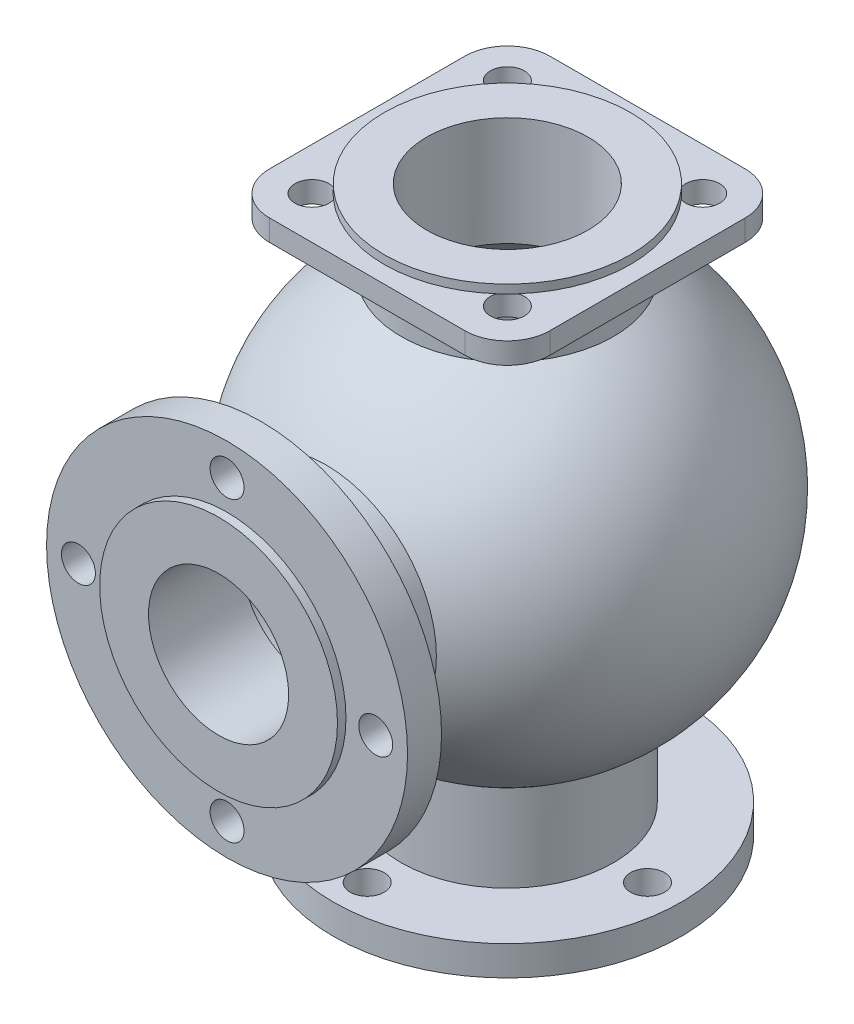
ISO-10303-21;
HEADER;
FILE_DESCRIPTION(('STEP AP214'),'2;1');
FILE_NAME('part.step','',(''),(''),'','','');
FILE_SCHEMA(('AUTOMOTIVE_DESIGN { 1 0 10303 214 1 1 1 1 }'));
ENDSEC;
DATA;
#1=APPLICATION_CONTEXT('core data for automotive mechanical design processes');
#2=APPLICATION_PROTOCOL_DEFINITION('international standard','automotive_design',2000,#1);
#3=PRODUCT_CONTEXT('',#1,'mechanical');
#4=PRODUCT('Part','Part','',(#3));
#5=PRODUCT_RELATED_PRODUCT_CATEGORY('part','',(#4));
#6=PRODUCT_DEFINITION_FORMATION('','',#4);
#7=PRODUCT_DEFINITION_CONTEXT('part definition',#1,'design');
#8=PRODUCT_DEFINITION('design','',#6,#7);
#9=PRODUCT_DEFINITION_SHAPE('','',#8);
#10=(LENGTH_UNIT() NAMED_UNIT(*) SI_UNIT(.MILLI.,.METRE.));
#11=(NAMED_UNIT(*) PLANE_ANGLE_UNIT() SI_UNIT($,.RADIAN.));
#12=(NAMED_UNIT(*) SI_UNIT($,.STERADIAN.) SOLID_ANGLE_UNIT());
#13=UNCERTAINTY_MEASURE_WITH_UNIT(LENGTH_MEASURE(1.E-05),#10,'distance_accuracy_value','');
#14=(GEOMETRIC_REPRESENTATION_CONTEXT(3) GLOBAL_UNCERTAINTY_ASSIGNED_CONTEXT((#13)) GLOBAL_UNIT_ASSIGNED_CONTEXT((#10,
#11,#12)) REPRESENTATION_CONTEXT('',''));
#15=CARTESIAN_POINT('',(0.,0.,0.));
#16=DIRECTION('',(0.,0.,1.));
#17=DIRECTION('',(1.,0.,0.));
#18=AXIS2_PLACEMENT_3D('',#15,#16,#17);
#19=CARTESIAN_POINT('',(0.,0.,0.));
#20=DIRECTION('',(0.,1.,0.));
#21=DIRECTION('',(0.,0.,-1.));
#22=AXIS2_PLACEMENT_3D('',#19,#20,#21);
#23=SPHERICAL_SURFACE('',#22,50.);
#24=CARTESIAN_POINT('',(0.,-43.3012701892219,0.));
#25=DIRECTION('',(0.,1.,0.));
#26=DIRECTION('',(0.,0.,1.));
#27=AXIS2_PLACEMENT_3D('',#24,#25,#26);
#28=CIRCLE('',#27,25.);
#29=CARTESIAN_POINT('',(0.,-43.3012701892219,25.));
#30=VERTEX_POINT('',#29);
#31=EDGE_CURVE('E318',#30,#30,#28,.F.);
#32=ORIENTED_EDGE('',*,*,#31,.F.);
#33=EDGE_LOOP('',(#32));
#34=FACE_BOUND('',#33,.T.);
#35=CARTESIAN_POINT('',(0.,43.3012701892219,0.));
#36=DIRECTION('',(0.,-1.,0.));
#37=DIRECTION('',(0.,0.,-1.));
#38=AXIS2_PLACEMENT_3D('',#35,#36,#37);
#39=CIRCLE('',#38,25.);
#40=CARTESIAN_POINT('',(0.,43.3012701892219,-25.));
#41=VERTEX_POINT('',#40);
#42=EDGE_CURVE('E135',#41,#41,#39,.F.);
#43=ORIENTED_EDGE('',*,*,#42,.F.);
#44=EDGE_LOOP('',(#43));
#45=FACE_BOUND('',#44,.T.);
#46=CARTESIAN_POINT('',(0.,0.,42.7083130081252));
#47=DIRECTION('',(0.,0.,-1.));
#48=DIRECTION('',(-1.,0.,0.));
#49=AXIS2_PLACEMENT_3D('',#46,#47,#48);
#50=CIRCLE('',#49,26.);
#51=CARTESIAN_POINT('',(-26.,0.,42.7083130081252));
#52=VERTEX_POINT('',#51);
#53=EDGE_CURVE('E251',#52,#52,#50,.F.);
#54=ORIENTED_EDGE('',*,*,#53,.F.);
#55=EDGE_LOOP('',(#54));
#56=FACE_BOUND('',#55,.T.);
#57=CARTESIAN_POINT('',(-5.87858523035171,-29.2009311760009,-40.1590320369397));
#58=CARTESIAN_POINT('',(-5.79430093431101,-29.6134992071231,-39.8713753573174));
#59=CARTESIAN_POINT('',(-5.66614161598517,-30.0193430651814,-39.5852844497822));
#60=CARTESIAN_POINT('',(-5.32201063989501,-30.8035721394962,-39.0266325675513));
#61=CARTESIAN_POINT('',(-5.10587525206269,-31.1819045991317,-38.7540978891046));
#62=CARTESIAN_POINT('',(-4.65288871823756,-31.8023259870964,-38.3028321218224));
#63=CARTESIAN_POINT('',(-4.4357363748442,-32.0543969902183,-38.1180291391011));
#64=CARTESIAN_POINT('',(-3.95382916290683,-32.5255325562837,-37.770361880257));
#65=CARTESIAN_POINT('',(-3.68917388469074,-32.7446644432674,-37.607452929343));
#66=CARTESIAN_POINT('',(-3.16550147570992,-33.1050726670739,-37.3380611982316));
#67=CARTESIAN_POINT('',(-2.9138227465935,-33.2532643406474,-37.2266954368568));
#68=CARTESIAN_POINT('',(-2.51613468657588,-33.4489424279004,-37.0791269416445));
#69=CARTESIAN_POINT('',(-2.38014908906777,-33.5097534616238,-37.0331689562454));
#70=CARTESIAN_POINT('',(-2.10212143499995,-33.6216997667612,-36.9484317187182));
#71=CARTESIAN_POINT('',(-1.96008206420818,-33.6728392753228,-36.9096493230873));
#72=CARTESIAN_POINT('',(-1.66973858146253,-33.7650103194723,-36.8396614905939));
#73=CARTESIAN_POINT('',(-1.52139644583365,-33.8059657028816,-36.8085131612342));
#74=CARTESIAN_POINT('',(-1.22051685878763,-33.8765815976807,-36.7547569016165));
#75=CARTESIAN_POINT('',(-1.06797937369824,-33.9062420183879,-36.7321490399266));
#76=CARTESIAN_POINT('',(-0.760100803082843,-33.9536957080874,-36.6959584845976));
#77=CARTESIAN_POINT('',(-0.604761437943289,-33.9714960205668,-36.6823704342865));
#78=CARTESIAN_POINT('',(-0.292641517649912,-33.9949014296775,-36.6645005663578));
#79=CARTESIAN_POINT('',(-0.135861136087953,-34.0005079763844,-36.6602176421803));
#80=CARTESIAN_POINT('',(0.158882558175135,-33.9994844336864,-36.660999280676));
#81=CARTESIAN_POINT('',(0.296856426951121,-33.9942361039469,-36.6650083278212));
#82=CARTESIAN_POINT('',(0.571766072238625,-33.9742848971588,-36.6802413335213));
#83=CARTESIAN_POINT('',(0.708701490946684,-33.9595788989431,-36.6914676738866));
#84=CARTESIAN_POINT('',(0.980430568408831,-33.9209443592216,-36.7209386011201));
#85=CARTESIAN_POINT('',(1.11522514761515,-33.8970198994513,-36.739180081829));
#86=CARTESIAN_POINT('',(1.38188111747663,-33.8402907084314,-36.782389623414));
#87=CARTESIAN_POINT('',(1.51374135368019,-33.8074825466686,-36.8073602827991));
#88=CARTESIAN_POINT('',(1.7724213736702,-33.7337971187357,-36.8633712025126));
#89=CARTESIAN_POINT('',(1.89927764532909,-33.6930012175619,-36.8943502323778));
#90=CARTESIAN_POINT('',(2.14865280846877,-33.6036469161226,-36.9621011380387));
#91=CARTESIAN_POINT('',(2.27117017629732,-33.5550858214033,-36.9988750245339));
#92=CARTESIAN_POINT('',(2.63131888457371,-33.3985718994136,-37.1171953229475));
#93=CARTESIAN_POINT('',(2.86170673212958,-33.279742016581,-37.2067757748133));
#94=CARTESIAN_POINT('',(3.3265831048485,-33.0016037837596,-37.4155359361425));
#95=CARTESIAN_POINT('',(3.55811661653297,-32.839119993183,-37.5369973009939));
#96=CARTESIAN_POINT('',(3.99057412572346,-32.4891846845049,-37.7971242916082));
#97=CARTESIAN_POINT('',(4.19148003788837,-32.3017185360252,-37.9357999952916));
#98=CARTESIAN_POINT('',(4.59707000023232,-31.8692079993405,-38.2538119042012));
#99=CARTESIAN_POINT('',(4.79518113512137,-31.6199984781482,-38.435861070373));
#100=CARTESIAN_POINT('',(5.1464486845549,-31.1004179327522,-38.8125263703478));
#101=CARTESIAN_POINT('',(5.29957550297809,-30.8300331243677,-39.0071506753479));
#102=CARTESIAN_POINT('',(5.58588085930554,-30.220730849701,-39.4422966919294));
#103=CARTESIAN_POINT('',(5.70971118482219,-29.8785663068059,-39.6845021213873));
#104=CARTESIAN_POINT('',(5.84764204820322,-29.3556100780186,-40.0512291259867));
#105=CARTESIAN_POINT('',(5.88565852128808,-29.179562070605,-40.1741177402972));
#106=CARTESIAN_POINT('',(5.94572129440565,-28.8250455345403,-40.4204475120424));
#107=CARTESIAN_POINT('',(5.9677654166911,-28.6465766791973,-40.5438887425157));
#108=CARTESIAN_POINT('',(5.99741955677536,-28.2670978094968,-40.8051657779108));
#109=CARTESIAN_POINT('',(6.0030176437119,-28.0659146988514,-40.9429800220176));
#110=CARTESIAN_POINT('',(5.99392491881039,-27.6632178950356,-41.2174554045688));
#111=CARTESIAN_POINT('',(5.97923429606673,-27.4617042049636,-41.3541165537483));
#112=CARTESIAN_POINT('',(5.9293199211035,-27.0596692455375,-41.6254361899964));
#113=CARTESIAN_POINT('',(5.89408296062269,-26.8591486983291,-41.760093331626));
#114=CARTESIAN_POINT('',(5.80280538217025,-26.4607760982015,-42.0263520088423));
#115=CARTESIAN_POINT('',(5.74676240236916,-26.2629243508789,-42.1579531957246));
#116=CARTESIAN_POINT('',(5.61394440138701,-25.8725780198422,-42.4164148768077));
#117=CARTESIAN_POINT('',(5.53727084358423,-25.68006217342,-42.5432952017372));
#118=CARTESIAN_POINT('',(5.3629165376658,-25.301380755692,-42.7917995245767));
#119=CARTESIAN_POINT('',(5.26524723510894,-25.1152117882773,-42.9134263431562));
#120=CARTESIAN_POINT('',(5.04893798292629,-24.7514707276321,-43.1501057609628));
#121=CARTESIAN_POINT('',(4.9303267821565,-24.5738872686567,-43.2651670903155));
#122=CARTESIAN_POINT('',(4.67216259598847,-24.2294330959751,-43.4875165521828));
#123=CARTESIAN_POINT('',(4.53261862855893,-24.0625578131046,-43.5948080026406));
#124=CARTESIAN_POINT('',(4.27668739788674,-23.7888105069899,-43.7702172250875));
#125=CARTESIAN_POINT('',(4.16539779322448,-23.6786212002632,-43.8406411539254));
#126=CARTESIAN_POINT('',(3.93279074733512,-23.4659091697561,-43.9762854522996));
#127=CARTESIAN_POINT('',(3.81147566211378,-23.3633846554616,-44.0415070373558));
#128=CARTESIAN_POINT('',(3.55921452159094,-23.1670363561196,-44.1661618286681));
#129=CARTESIAN_POINT('',(3.42826921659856,-23.0732118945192,-44.2255954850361));
#130=CARTESIAN_POINT('',(3.15736505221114,-22.895366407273,-44.3380495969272));
#131=CARTESIAN_POINT('',(3.01741061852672,-22.8113406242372,-44.3910731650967));
#132=CARTESIAN_POINT('',(2.72814514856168,-22.6535471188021,-44.4904917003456));
#133=CARTESIAN_POINT('',(2.57877427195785,-22.5798571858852,-44.5368364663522));
#134=CARTESIAN_POINT('',(2.27263601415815,-22.4445417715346,-44.6218272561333));
#135=CARTESIAN_POINT('',(2.11587216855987,-22.3829105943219,-44.6604769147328));
#136=CARTESIAN_POINT('',(1.7961168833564,-22.272648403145,-44.7295526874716));
#137=CARTESIAN_POINT('',(1.63312698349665,-22.2240141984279,-44.7599808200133));
#138=CARTESIAN_POINT('',(1.30229819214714,-22.140553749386,-44.8121598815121));
#139=CARTESIAN_POINT('',(1.13445995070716,-22.1057256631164,-44.8339119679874));
#140=CARTESIAN_POINT('',(0.815126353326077,-22.0536871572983,-44.8663988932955));
#141=CARTESIAN_POINT('',(0.663984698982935,-22.0349055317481,-44.8781166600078));
#142=CARTESIAN_POINT('',(0.360330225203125,-22.0088919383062,-44.8943439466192));
#143=CARTESIAN_POINT('',(0.207817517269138,-22.0016590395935,-44.8988540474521));
#144=CARTESIAN_POINT('',(-0.0973018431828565,-21.9988498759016,-44.9006058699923));
#145=CARTESIAN_POINT('',(-0.249908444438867,-22.0032695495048,-44.8978501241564));
#146=CARTESIAN_POINT('',(-0.55403924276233,-22.0236912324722,-44.8851125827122));
#147=CARTESIAN_POINT('',(-0.705563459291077,-22.0396930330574,-44.8751309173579));
#148=CARTESIAN_POINT('',(-0.9974707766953,-22.0817652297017,-44.8488718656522));
#149=CARTESIAN_POINT('',(-1.1379846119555,-22.1071874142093,-44.8329997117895));
#150=CARTESIAN_POINT('',(-1.4161041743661,-22.167769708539,-44.7951476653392));
#151=CARTESIAN_POINT('',(-1.55370895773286,-22.202932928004,-44.7731658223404));
#152=CARTESIAN_POINT('',(-1.82505547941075,-22.2825566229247,-44.7233434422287));
#153=CARTESIAN_POINT('',(-1.95879852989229,-22.3270138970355,-44.695504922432));
#154=CARTESIAN_POINT('',(-2.2217552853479,-22.4247431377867,-44.6342393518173));
#155=CARTESIAN_POINT('',(-2.35096724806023,-22.4780184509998,-44.6008101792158));
#156=CARTESIAN_POINT('',(-2.60910760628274,-22.5950567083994,-44.5272750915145));
#157=CARTESIAN_POINT('',(-2.73782729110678,-22.659148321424,-44.4869591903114));
#158=CARTESIAN_POINT('',(-2.98900919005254,-22.7955520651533,-44.401024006));
#159=CARTESIAN_POINT('',(-3.11146913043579,-22.8678671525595,-44.355402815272));
#160=CARTESIAN_POINT('',(-3.46862706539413,-23.0960897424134,-44.2111773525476));
#161=CARTESIAN_POINT('',(-3.69324823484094,-23.2633412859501,-44.1051693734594));
#162=CARTESIAN_POINT('',(-4.13620254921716,-23.6426657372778,-43.8637306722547));
#163=CARTESIAN_POINT('',(-4.35091523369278,-23.8576728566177,-43.7263248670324));
#164=CARTESIAN_POINT('',(-4.7412277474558,-24.3107924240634,-43.4352027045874));
#165=CARTESIAN_POINT('',(-4.91681209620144,-24.5489139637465,-43.2814799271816));
#166=CARTESIAN_POINT('',(-5.25223957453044,-25.0798697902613,-42.9367130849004));
#167=CARTESIAN_POINT('',(-5.40550840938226,-25.3754862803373,-42.7435652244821));
#168=CARTESIAN_POINT('',(-5.65962997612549,-25.9809468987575,-42.3450913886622));
#169=CARTESIAN_POINT('',(-5.76042227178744,-26.2908069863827,-42.1397516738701));
#170=CARTESIAN_POINT('',(-5.92197019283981,-26.9661637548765,-41.6887656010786));
#171=CARTESIAN_POINT('',(-5.97410199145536,-27.3328416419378,-41.4418038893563));
#172=CARTESIAN_POINT('',(-6.01082056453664,-28.0657997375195,-40.943584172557));
#173=CARTESIAN_POINT('',(-5.99553799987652,-28.4320793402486,-40.6923354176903));
#174=CARTESIAN_POINT('',(-5.93815504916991,-28.8620034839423,-40.3946785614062));
#175=CARTESIAN_POINT('',(-5.92788271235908,-28.9300219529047,-40.3475028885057));
#176=CARTESIAN_POINT('',(-5.90499399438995,-29.0657307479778,-40.2532148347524));
#177=CARTESIAN_POINT('',(-5.89237701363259,-29.1334209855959,-40.2061024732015));
#178=CARTESIAN_POINT('',(-5.87858523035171,-29.2009311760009,-40.1590320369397));
#179=B_SPLINE_CURVE_WITH_KNOTS('',3,(#57,#58,#59,#60,#61,#62,#63,#64,#65,#66,#67,#68,#69,#70,
#71,#72,#73,#74,#75,#76,#77,#78,#79,#80,#81,#82,#83,#84,#85,#86,#87,#88,#89,#90,#91,#92,#93,#94,
#95,#96,#97,#98,#99,#100,#101,#102,#103,#104,#105,#106,#107,#108,#109,#110,#111,#112,#113,#114,
#115,#116,#117,#118,#119,#120,#121,#122,#123,#124,#125,#126,#127,#128,#129,#130,#131,#132,#133,
#134,#135,#136,#137,#138,#139,#140,#141,#142,#143,#144,#145,#146,#147,#148,#149,#150,#151,#152,
#153,#154,#155,#156,#157,#158,#159,#160,#161,#162,#163,#164,#165,#166,#167,#168,#169,#170,#171,
#172,#173,#174,#175,#176,#177,#178),.UNSPECIFIED.,.T.,.F.,(4,2,2,2,2,2,2,2,2,2,2,2,2,2,2,2,2,2,
2,2,2,2,2,2,2,2,2,2,2,2,2,2,2,2,2,2,2,2,2,2,2,2,2,2,2,2,2,2,2,2,2,2,2,2,2,2,2,2,2,2,4),(0.,
1.52954269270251,3.06194508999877,4.19936673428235,5.33443104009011,6.26801015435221,
6.73519162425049,7.20216794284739,7.67253764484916,8.14291112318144,8.61300500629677,
9.08304298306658,9.49693106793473,9.91095581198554,10.3247974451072,10.7387991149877,
11.1487845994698,11.5589126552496,12.3786634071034,13.2988350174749,14.2195478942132,
15.3156783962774,16.4125284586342,17.7182031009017,18.3718432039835,19.0255724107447,
19.756500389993,20.4874215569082,21.2188131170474,21.9502877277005,22.6782286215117,
23.4057736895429,24.1323276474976,24.858569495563,25.3732307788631,25.8877714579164,
26.4022720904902,26.9165218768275,27.4344552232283,27.9521433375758,28.4697042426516,
28.9871960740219,29.4448645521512,29.9024961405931,30.3599682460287,30.8174321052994,
31.2479644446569,31.6786343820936,32.1091562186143,32.5398418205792,32.987370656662,
33.4350609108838,34.3299514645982,35.3266172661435,36.3236766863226,37.4740830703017,
38.6258114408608,39.956002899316,41.2836173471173,41.5338385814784,41.7841238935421),.UNSPECIFIED.);
#180=CARTESIAN_POINT('',(-5.87858523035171,-29.2009311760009,-40.1590320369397));
#181=VERTEX_POINT('',#180);
#182=EDGE_CURVE('E40',#181,#181,#179,.T.);
#183=ORIENTED_EDGE('',*,*,#182,.T.);
#184=EDGE_LOOP('',(#183));
#185=FACE_BOUND('',#184,.T.);
#186=ADVANCED_FACE('F36',(#34,#45,#56,#185),#23,.T.);
#187=CARTESIAN_POINT('',(0.,0.,0.));
#188=DIRECTION('',(0.,1.,0.));
#189=DIRECTION('',(0.,0.,1.));
#190=AXIS2_PLACEMENT_3D('',#187,#188,#189);
#191=SPHERICAL_SURFACE('',#190,41.);
#192=CARTESIAN_POINT('',(-2.31931630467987,-25.3787836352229,-32.1175664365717));
#193=CARTESIAN_POINT('',(-2.19863528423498,-25.2719910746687,-32.2106698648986));
#194=CARTESIAN_POINT('',(-2.0681337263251,-25.1713656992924,-32.2979866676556));
#195=CARTESIAN_POINT('',(-1.78768986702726,-24.9863210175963,-32.4580098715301));
#196=CARTESIAN_POINT('',(-1.63775377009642,-24.9018965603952,-32.5307209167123));
#197=CARTESIAN_POINT('',(-1.39933653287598,-24.7906874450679,-32.6262553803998));
#198=CARTESIAN_POINT('',(-1.31715521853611,-24.7560518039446,-32.6559617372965));
#199=CARTESIAN_POINT('',(-1.14890829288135,-24.6927245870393,-32.7102148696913));
#200=CARTESIAN_POINT('',(-1.06284480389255,-24.6640298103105,-32.7347644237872));
#201=CARTESIAN_POINT('',(-0.887488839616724,-24.613158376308,-32.7782489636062));
#202=CARTESIAN_POINT('',(-0.798198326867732,-24.5909778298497,-32.7971872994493));
#203=CARTESIAN_POINT('',(-0.61712240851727,-24.553596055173,-32.8290858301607));
#204=CARTESIAN_POINT('',(-0.525337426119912,-24.5383936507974,-32.842047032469));
#205=CARTESIAN_POINT('',(-0.352078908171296,-24.5168037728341,-32.8604482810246));
#206=CARTESIAN_POINT('',(-0.270793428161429,-24.5095355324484,-32.8666399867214));
#207=CARTESIAN_POINT('',(-0.107658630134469,-24.5007023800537,-32.874164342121));
#208=CARTESIAN_POINT('',(-0.0258091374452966,-24.4991393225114,-32.8754954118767));
#209=CARTESIAN_POINT('',(0.137679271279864,-24.5017546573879,-32.8732678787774));
#210=CARTESIAN_POINT('',(0.219318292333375,-24.5059291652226,-32.8697125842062));
#211=CARTESIAN_POINT('',(0.381765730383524,-24.5199258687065,-32.857787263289));
#212=CARTESIAN_POINT('',(0.462573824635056,-24.5297501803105,-32.8494154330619));
#213=CARTESIAN_POINT('',(0.690015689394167,-24.5654606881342,-32.818967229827));
#214=CARTESIAN_POINT('',(0.83495084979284,-24.5979069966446,-32.7912860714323));
#215=CARTESIAN_POINT('',(1.11623332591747,-24.6795279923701,-32.7215163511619));
#216=CARTESIAN_POINT('',(1.25257972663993,-24.7287044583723,-32.6794262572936));
#217=CARTESIAN_POINT('',(1.52408104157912,-24.8455455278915,-32.5791671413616));
#218=CARTESIAN_POINT('',(1.65840816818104,-24.9143052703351,-32.5200420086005));
#219=CARTESIAN_POINT('',(1.91289872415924,-25.0652489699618,-32.3898179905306));
#220=CARTESIAN_POINT('',(2.0330531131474,-25.1474414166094,-32.318711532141));
#221=CARTESIAN_POINT('',(2.31261138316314,-25.3644024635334,-32.1302974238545));
#222=CARTESIAN_POINT('',(2.46322966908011,-25.5054905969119,-32.0071792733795));
#223=CARTESIAN_POINT('',(2.73224367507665,-25.803341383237,-31.7455525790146));
#224=CARTESIAN_POINT('',(2.85056716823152,-25.960138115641,-31.6070104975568));
#225=CARTESIAN_POINT('',(3.08797877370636,-26.3334962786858,-31.2747423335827));
#226=CARTESIAN_POINT('',(3.19608827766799,-26.553596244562,-31.077157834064));
#227=CARTESIAN_POINT('',(3.36310177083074,-27.0016080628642,-30.6708552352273));
#228=CARTESIAN_POINT('',(3.42198231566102,-27.2295235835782,-30.4621318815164));
#229=CARTESIAN_POINT('',(3.4942674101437,-27.6908906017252,-30.0350880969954));
#230=CARTESIAN_POINT('',(3.50686328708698,-27.9243694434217,-29.8166638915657));
#231=CARTESIAN_POINT('',(3.48615900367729,-28.388103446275,-29.3779561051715));
#232=CARTESIAN_POINT('',(3.45280697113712,-28.6183546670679,-29.1576707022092));
#233=CARTESIAN_POINT('',(3.36408290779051,-28.9752634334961,-28.812348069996));
#234=CARTESIAN_POINT('',(3.32386147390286,-29.1047800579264,-28.6861988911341));
#235=CARTESIAN_POINT('',(3.22781478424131,-29.3600806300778,-28.4359124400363));
#236=CARTESIAN_POINT('',(3.17198452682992,-29.48586336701,-28.311775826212));
#237=CARTESIAN_POINT('',(3.04441637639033,-29.7322665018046,-28.0670274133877));
#238=CARTESIAN_POINT('',(2.97270561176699,-29.8528952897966,-27.9464099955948));
#239=CARTESIAN_POINT('',(2.81275139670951,-30.0877248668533,-27.710130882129));
#240=CARTESIAN_POINT('',(2.72452045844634,-30.2019304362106,-27.594465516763));
#241=CARTESIAN_POINT('',(2.51473221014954,-30.4403556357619,-27.3515469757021));
#242=CARTESIAN_POINT('',(2.39008104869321,-30.563137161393,-27.2255127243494));
#243=CARTESIAN_POINT('',(2.11601648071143,-30.7936422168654,-26.9874074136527));
#244=CARTESIAN_POINT('',(1.96664430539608,-30.9013902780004,-26.8753136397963));
#245=CARTESIAN_POINT('',(1.67798257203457,-31.0750969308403,-26.6936503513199));
#246=CARTESIAN_POINT('',(1.54360423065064,-31.1450440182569,-26.6201389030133));
#247=CARTESIAN_POINT('',(1.26019241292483,-31.2689036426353,-26.4895387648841));
#248=CARTESIAN_POINT('',(1.11117758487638,-31.3228362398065,-26.4324295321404));
#249=CARTESIAN_POINT('',(0.826402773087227,-31.4037132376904,-26.3466052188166));
#250=CARTESIAN_POINT('',(0.692431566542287,-31.4336211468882,-26.3147819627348));
#251=CARTESIAN_POINT('',(0.41904092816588,-31.4775747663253,-26.2679724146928));
#252=CARTESIAN_POINT('',(0.279625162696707,-31.4916309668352,-26.252974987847));
#253=CARTESIAN_POINT('',(-0.00100536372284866,-31.5028219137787,-26.2410368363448));
#254=CARTESIAN_POINT('',(-0.142223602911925,-31.4999165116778,-26.2441389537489));
#255=CARTESIAN_POINT('',(-0.421754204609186,-31.4773271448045,-26.268228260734));
#256=CARTESIAN_POINT('',(-0.560065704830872,-31.4576382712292,-26.2892206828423));
#257=CARTESIAN_POINT('',(-0.826068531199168,-31.4037498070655,-26.3465517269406));
#258=CARTESIAN_POINT('',(-0.953951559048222,-31.3699878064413,-26.3824274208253));
#259=CARTESIAN_POINT('',(-1.20115567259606,-31.2900056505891,-26.4671774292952));
#260=CARTESIAN_POINT('',(-1.32047300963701,-31.2437800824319,-26.5160573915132));
#261=CARTESIAN_POINT('',(-1.60402638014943,-31.1163206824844,-26.650373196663));
#262=CARTESIAN_POINT('',(-1.76250657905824,-31.0289100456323,-26.7421196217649));
#263=CARTESIAN_POINT('',(-2.05715508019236,-30.837109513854,-26.9421966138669));
#264=CARTESIAN_POINT('',(-2.19326924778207,-30.7326796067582,-27.0505662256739));
#265=CARTESIAN_POINT('',(-2.49413583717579,-30.4666226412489,-27.3247970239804));
#266=CARTESIAN_POINT('',(-2.64841041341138,-30.2988765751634,-27.4962591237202));
#267=CARTESIAN_POINT('',(-2.84973852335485,-30.035007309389,-27.7632432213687));
#268=CARTESIAN_POINT('',(-2.91188481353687,-29.9449050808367,-27.8539732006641));
#269=CARTESIAN_POINT('',(-3.02652561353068,-29.7612090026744,-28.0380228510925));
#270=CARTESIAN_POINT('',(-3.07902024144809,-29.667615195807,-28.1313424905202));
#271=CARTESIAN_POINT('',(-3.18771290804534,-29.4515050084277,-28.3457254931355));
#272=CARTESIAN_POINT('',(-3.24097667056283,-29.3280975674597,-28.4673771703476));
#273=CARTESIAN_POINT('',(-3.3326189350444,-29.0776956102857,-28.7126120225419));
#274=CARTESIAN_POINT('',(-3.37099358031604,-28.9507001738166,-28.8361956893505));
#275=CARTESIAN_POINT('',(-3.43304767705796,-28.6939951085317,-29.0843889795));
#276=CARTESIAN_POINT('',(-3.45671791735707,-28.5642838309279,-29.2089991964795));
#277=CARTESIAN_POINT('',(-3.48933176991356,-28.3031224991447,-29.4582871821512));
#278=CARTESIAN_POINT('',(-3.49827674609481,-28.171672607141,-29.582964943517));
#279=CARTESIAN_POINT('',(-3.50128056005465,-27.9070550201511,-29.83237403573));
#280=CARTESIAN_POINT('',(-3.49524642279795,-27.7738817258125,-29.9571008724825));
#281=CARTESIAN_POINT('',(-3.46778731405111,-27.507674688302,-30.2048944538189));
#282=CARTESIAN_POINT('',(-3.44636045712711,-27.3746409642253,-30.3279609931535));
#283=CARTESIAN_POINT('',(-3.35821914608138,-26.9773442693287,-30.6932805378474));
#284=CARTESIAN_POINT('',(-3.26765354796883,-26.7143733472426,-30.9321359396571));
#285=CARTESIAN_POINT('',(-3.09514559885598,-26.362368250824,-31.2484430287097));
#286=CARTESIAN_POINT('',(-3.04237592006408,-26.2661484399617,-31.3345306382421));
#287=CARTESIAN_POINT('',(-2.92644974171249,-26.0769238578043,-31.5031642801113));
#288=CARTESIAN_POINT('',(-2.86329325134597,-25.9839190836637,-31.5857103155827));
#289=CARTESIAN_POINT('',(-2.65796563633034,-25.7116169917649,-31.8264821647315));
#290=CARTESIAN_POINT('',(-2.49959908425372,-25.5383187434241,-31.978481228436));
#291=CARTESIAN_POINT('',(-2.31931630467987,-25.3787836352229,-32.1175664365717));
#292=B_SPLINE_CURVE_WITH_KNOTS('',3,(#192,#193,#194,#195,#196,#197,#198,#199,#200,#201,#202,
#203,#204,#205,#206,#207,#208,#209,#210,#211,#212,#213,#214,#215,#216,#217,#218,#219,#220,#221,
#222,#223,#224,#225,#226,#227,#228,#229,#230,#231,#232,#233,#234,#235,#236,#237,#238,#239,#240,
#241,#242,#243,#244,#245,#246,#247,#248,#249,#250,#251,#252,#253,#254,#255,#256,#257,#258,#259,
#260,#261,#262,#263,#264,#265,#266,#267,#268,#269,#270,#271,#272,#273,#274,#275,#276,#277,#278,
#279,#280,#281,#282,#283,#284,#285,#286,#287,#288,#289,#290,#291),.UNSPECIFIED.,.T.,.F.,(4,2,2,
2,2,2,2,2,2,2,2,2,2,2,2,2,2,2,2,2,2,2,2,2,2,2,2,2,2,2,2,2,2,2,2,2,2,2,2,2,2,2,2,2,2,2,2,2,2,4),
(0.,0.557691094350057,1.11520458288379,1.39686470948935,1.67837267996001,1.95971223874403,
2.24100436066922,2.48620348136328,2.73148229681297,2.9765951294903,3.22179982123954,
3.67288520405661,4.12401856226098,4.60838738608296,5.09306352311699,5.81001295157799,
6.52855292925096,7.46829829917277,8.40849095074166,9.36503432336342,10.322658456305,
10.8777188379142,11.4329572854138,11.9872544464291,12.5411334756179,13.1860247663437,
13.8298511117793,14.333200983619,14.8359176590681,15.2568319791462,15.6774675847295,
16.0990992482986,16.52085427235,16.9303724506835,17.3400687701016,17.9453916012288,
18.5521586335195,19.4027996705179,19.8290432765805,20.2552816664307,20.7984440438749,
21.3417470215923,21.8853899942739,22.4289826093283,22.9759577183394,23.5229998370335,
24.6149972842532,25.0330640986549,25.4511305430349,26.2842532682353),.UNSPECIFIED.);
#293=CARTESIAN_POINT('',(-2.31931630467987,-25.3787836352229,-32.1175664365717));
#294=VERTEX_POINT('',#293);
#295=EDGE_CURVE('E380',#294,#294,#292,.T.);
#296=ORIENTED_EDGE('',*,*,#295,.T.);
#297=EDGE_LOOP('',(#296));
#298=FACE_BOUND('',#297,.T.);
#299=CARTESIAN_POINT('',(0.,-36.3318042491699,0.));
#300=DIRECTION('',(0.,1.,0.));
#301=DIRECTION('',(0.,0.,1.));
#302=AXIS2_PLACEMENT_3D('',#299,#300,#301);
#303=CIRCLE('',#302,19.);
#304=CARTESIAN_POINT('',(0.,-36.3318042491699,-19.));
#305=VERTEX_POINT('',#304);
#306=EDGE_CURVE('E369',#305,#305,#303,.F.);
#307=ORIENTED_EDGE('',*,*,#306,.T.);
#308=EDGE_LOOP('',(#307));
#309=FACE_BOUND('',#308,.T.);
#310=CARTESIAN_POINT('',(0.,0.,36.8374809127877));
#311=DIRECTION('',(0.,0.,-1.));
#312=DIRECTION('',(-1.,0.,0.));
#313=AXIS2_PLACEMENT_3D('',#310,#311,#312);
#314=CIRCLE('',#313,18.);
#315=CARTESIAN_POINT('',(-18.,0.,36.8374809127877));
#316=VERTEX_POINT('',#315);
#317=EDGE_CURVE('E276',#316,#316,#314,.F.);
#318=ORIENTED_EDGE('',*,*,#317,.T.);
#319=EDGE_LOOP('',(#318));
#320=FACE_BOUND('',#319,.T.);
#321=CARTESIAN_POINT('',(0.,36.3318042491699,0.));
#322=DIRECTION('',(0.,-1.,0.));
#323=DIRECTION('',(0.,0.,-1.));
#324=AXIS2_PLACEMENT_3D('',#321,#322,#323);
#325=CIRCLE('',#324,19.);
#326=CARTESIAN_POINT('',(0.,36.3318042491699,-19.));
#327=VERTEX_POINT('',#326);
#328=EDGE_CURVE('E248',#327,#327,#325,.F.);
#329=ORIENTED_EDGE('',*,*,#328,.T.);
#330=EDGE_LOOP('',(#329));
#331=FACE_BOUND('',#330,.T.);
#332=ADVANCED_FACE('F536',(#298,#309,#320,#331),#191,.F.);
#333=CARTESIAN_POINT('',(0.,-50.001,0.));
#334=DIRECTION('',(0.,1.,0.));
#335=DIRECTION('',(0.,0.,1.));
#336=AXIS2_PLACEMENT_3D('',#333,#334,#335);
#337=CYLINDRICAL_SURFACE('',#336,19.);
#338=ORIENTED_EDGE('',*,*,#328,.F.);
#339=EDGE_LOOP('',(#338));
#340=FACE_BOUND('',#339,.T.);
#341=CARTESIAN_POINT('',(0.,62.,0.));
#342=DIRECTION('',(0.,1.,0.));
#343=DIRECTION('',(0.,0.,1.));
#344=AXIS2_PLACEMENT_3D('',#341,#342,#343);
#345=CIRCLE('',#344,19.);
#346=CARTESIAN_POINT('',(0.,62.,19.));
#347=VERTEX_POINT('',#346);
#348=EDGE_CURVE('E230',#347,#347,#345,.T.);
#349=ORIENTED_EDGE('',*,*,#348,.T.);
#350=EDGE_LOOP('',(#349));
#351=FACE_BOUND('',#350,.T.);
#352=ADVANCED_FACE('F532',(#340,#351),#337,.F.);
#353=CARTESIAN_POINT('',(0.,-50.001,0.));
#354=DIRECTION('',(0.,1.,0.));
#355=DIRECTION('',(0.,0.,1.));
#356=AXIS2_PLACEMENT_3D('',#353,#354,#355);
#357=CYLINDRICAL_SURFACE('',#356,25.);
#358=ORIENTED_EDGE('',*,*,#42,.T.);
#359=EDGE_LOOP('',(#358));
#360=FACE_BOUND('',#359,.T.);
#361=CARTESIAN_POINT('',(0.,55.,0.));
#362=DIRECTION('',(0.,-1.,0.));
#363=DIRECTION('',(0.,0.,-1.));
#364=AXIS2_PLACEMENT_3D('',#361,#362,#363);
#365=CIRCLE('',#364,25.);
#366=CARTESIAN_POINT('',(0.,55.,-25.));
#367=VERTEX_POINT('',#366);
#368=EDGE_CURVE('E169',#367,#367,#365,.T.);
#369=ORIENTED_EDGE('',*,*,#368,.T.);
#370=EDGE_LOOP('',(#369));
#371=FACE_BOUND('',#370,.T.);
#372=ADVANCED_FACE('F535',(#360,#371),#357,.T.);
#373=CARTESIAN_POINT('',(0.,60.,0.));
#374=DIRECTION('',(0.,1.,0.));
#375=DIRECTION('',(0.,0.,1.));
#376=AXIS2_PLACEMENT_3D('',#373,#374,#375);
#377=CYLINDRICAL_SURFACE('',#376,29.);
#378=CARTESIAN_POINT('',(0.,60.,0.));
#379=DIRECTION('',(0.,1.,0.));
#380=DIRECTION('',(0.,0.,1.));
#381=AXIS2_PLACEMENT_3D('',#378,#379,#380);
#382=CIRCLE('',#381,29.);
#383=CARTESIAN_POINT('',(19.2080687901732,60.,21.7267138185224));
#384=VERTEX_POINT('',#383);
#385=CARTESIAN_POINT('',(21.7267138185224,60.,19.2080687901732));
#386=VERTEX_POINT('',#385);
#387=EDGE_CURVE('E159',#384,#386,#382,.T.);
#388=ORIENTED_EDGE('',*,*,#387,.T.);
#389=CARTESIAN_POINT('',(21.7267138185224,60.,-19.2080687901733));
#390=VERTEX_POINT('',#389);
#391=EDGE_CURVE('E163',#386,#390,#382,.T.);
#392=ORIENTED_EDGE('',*,*,#391,.T.);
#393=CARTESIAN_POINT('',(19.2080687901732,60.,-21.7267138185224));
#394=VERTEX_POINT('',#393);
#395=EDGE_CURVE('E158',#390,#394,#382,.T.);
#396=ORIENTED_EDGE('',*,*,#395,.T.);
#397=CARTESIAN_POINT('',(-19.2080687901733,60.,-21.7267138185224));
#398=VERTEX_POINT('',#397);
#399=EDGE_CURVE('E157',#394,#398,#382,.T.);
#400=ORIENTED_EDGE('',*,*,#399,.T.);
#401=CARTESIAN_POINT('',(-21.7267138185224,60.,-19.2080687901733));
#402=VERTEX_POINT('',#401);
#403=EDGE_CURVE('E140',#398,#402,#382,.T.);
#404=ORIENTED_EDGE('',*,*,#403,.T.);
#405=CARTESIAN_POINT('',(-21.7267138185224,60.,19.2080687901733));
#406=VERTEX_POINT('',#405);
#407=EDGE_CURVE('E145',#402,#406,#382,.T.);
#408=ORIENTED_EDGE('',*,*,#407,.T.);
#409=CARTESIAN_POINT('',(-19.2080687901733,60.,21.7267138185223));
#410=VERTEX_POINT('',#409);
#411=EDGE_CURVE('E151',#406,#410,#382,.T.);
#412=ORIENTED_EDGE('',*,*,#411,.T.);
#413=EDGE_CURVE('E164',#410,#384,#382,.T.);
#414=ORIENTED_EDGE('',*,*,#413,.T.);
#415=EDGE_LOOP('',(#388,#392,#396,#400,#404,#408,#412,#414));
#416=FACE_BOUND('',#415,.T.);
#417=CARTESIAN_POINT('',(0.,62.,0.));
#418=DIRECTION('',(0.,1.,0.));
#419=DIRECTION('',(0.,0.,1.));
#420=AXIS2_PLACEMENT_3D('',#417,#418,#419);
#421=CIRCLE('',#420,29.);
#422=CARTESIAN_POINT('',(0.,62.,29.));
#423=VERTEX_POINT('',#422);
#424=EDGE_CURVE('E162',#423,#423,#421,.T.);
#425=ORIENTED_EDGE('',*,*,#424,.F.);
#426=EDGE_LOOP('',(#425));
#427=FACE_BOUND('',#426,.T.);
#428=ADVANCED_FACE('F154',(#416,#427),#377,.T.);
#429=CARTESIAN_POINT('',(0.,62.,0.));
#430=DIRECTION('',(0.,1.,0.));
#431=DIRECTION('',(0.,0.,1.));
#432=AXIS2_PLACEMENT_3D('',#429,#430,#431);
#433=PLANE('',#432);
#434=ORIENTED_EDGE('',*,*,#348,.F.);
#435=EDGE_LOOP('',(#434));
#436=FACE_BOUND('',#435,.T.);
#437=ORIENTED_EDGE('',*,*,#424,.T.);
#438=EDGE_LOOP('',(#437));
#439=FACE_BOUND('',#438,.T.);
#440=ADVANCED_FACE('F573',(#436,#439),#433,.T.);
#441=CARTESIAN_POINT('',(-23.,55.,-23.));
#442=DIRECTION('',(0.,1.,0.));
#443=DIRECTION('',(0.,0.,1.));
#444=AXIS2_PLACEMENT_3D('',#441,#442,#443);
#445=CYLINDRICAL_SURFACE('',#444,10.);
#446=CARTESIAN_POINT('',(-23.,60.,-23.));
#447=DIRECTION('',(0.,-1.,0.));
#448=DIRECTION('',(0.,0.,-1.));
#449=AXIS2_PLACEMENT_3D('',#446,#447,#448);
#450=CIRCLE('',#449,10.);
#451=CARTESIAN_POINT('',(-33.,60.,-22.9999999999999));
#452=VERTEX_POINT('',#451);
#453=CARTESIAN_POINT('',(-22.9999999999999,60.,-33.));
#454=VERTEX_POINT('',#453);
#455=EDGE_CURVE('E228',#452,#454,#450,.T.);
#456=ORIENTED_EDGE('',*,*,#455,.T.);
#457=DIRECTION('',(0.,1.,0.));
#458=VECTOR('',#457,1.);
#459=CARTESIAN_POINT('',(-22.9999999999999,55.,-33.));
#460=LINE('',#459,#458);
#461=CARTESIAN_POINT('',(-22.9999999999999,55.,-33.));
#462=VERTEX_POINT('',#461);
#463=EDGE_CURVE('E165',#462,#454,#460,.T.);
#464=ORIENTED_EDGE('',*,*,#463,.F.);
#465=CARTESIAN_POINT('',(-23.,55.,-23.));
#466=DIRECTION('',(0.,-1.,0.));
#467=DIRECTION('',(0.,0.,-1.));
#468=AXIS2_PLACEMENT_3D('',#465,#466,#467);
#469=CIRCLE('',#468,10.);
#470=CARTESIAN_POINT('',(-33.,55.,-22.9999999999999));
#471=VERTEX_POINT('',#470);
#472=EDGE_CURVE('E215',#471,#462,#469,.T.);
#473=ORIENTED_EDGE('',*,*,#472,.F.);
#474=DIRECTION('',(0.,1.,0.));
#475=VECTOR('',#474,1.);
#476=CARTESIAN_POINT('',(-33.,55.,-22.9999999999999));
#477=LINE('',#476,#475);
#478=EDGE_CURVE('E209',#471,#452,#477,.T.);
#479=ORIENTED_EDGE('',*,*,#478,.T.);
#480=EDGE_LOOP('',(#456,#464,#473,#479));
#481=FACE_BOUND('',#480,.T.);
#482=ADVANCED_FACE('F570',(#481),#445,.T.);
#483=CARTESIAN_POINT('',(-22.9999999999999,55.,-33.));
#484=DIRECTION('',(0.,0.,1.));
#485=DIRECTION('',(1.,0.,0.));
#486=AXIS2_PLACEMENT_3D('',#483,#484,#485);
#487=PLANE('',#486);
#488=DIRECTION('',(1.,0.,0.));
#489=VECTOR('',#488,1.);
#490=CARTESIAN_POINT('',(-22.9999999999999,60.,-33.));
#491=LINE('',#490,#489);
#492=CARTESIAN_POINT('',(22.9999999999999,60.,-33.));
#493=VERTEX_POINT('',#492);
#494=EDGE_CURVE('E226',#454,#493,#491,.T.);
#495=ORIENTED_EDGE('',*,*,#494,.T.);
#496=DIRECTION('',(0.,1.,0.));
#497=VECTOR('',#496,1.);
#498=CARTESIAN_POINT('',(22.9999999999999,55.,-33.));
#499=LINE('',#498,#497);
#500=CARTESIAN_POINT('',(22.9999999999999,55.,-33.));
#501=VERTEX_POINT('',#500);
#502=EDGE_CURVE('E184',#501,#493,#499,.T.);
#503=ORIENTED_EDGE('',*,*,#502,.F.);
#504=DIRECTION('',(1.,0.,0.));
#505=VECTOR('',#504,1.);
#506=CARTESIAN_POINT('',(-22.9999999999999,55.,-33.));
#507=LINE('',#506,#505);
#508=EDGE_CURVE('E242',#462,#501,#507,.T.);
#509=ORIENTED_EDGE('',*,*,#508,.F.);
#510=ORIENTED_EDGE('',*,*,#463,.T.);
#511=EDGE_LOOP('',(#495,#503,#509,#510));
#512=FACE_BOUND('',#511,.T.);
#513=ADVANCED_FACE('F567',(#512),#487,.F.);
#514=CARTESIAN_POINT('',(23.,55.,-23.));
#515=DIRECTION('',(0.,1.,0.));
#516=DIRECTION('',(0.,0.,1.));
#517=AXIS2_PLACEMENT_3D('',#514,#515,#516);
#518=CYLINDRICAL_SURFACE('',#517,10.);
#519=CARTESIAN_POINT('',(23.,60.,-23.));
#520=DIRECTION('',(0.,-1.,0.));
#521=DIRECTION('',(0.,0.,-1.));
#522=AXIS2_PLACEMENT_3D('',#519,#520,#521);
#523=CIRCLE('',#522,10.);
#524=CARTESIAN_POINT('',(33.,60.,-22.9999999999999));
#525=VERTEX_POINT('',#524);
#526=EDGE_CURVE('E224',#493,#525,#523,.T.);
#527=ORIENTED_EDGE('',*,*,#526,.T.);
#528=DIRECTION('',(0.,1.,0.));
#529=VECTOR('',#528,1.);
#530=CARTESIAN_POINT('',(33.,55.,-22.9999999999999));
#531=LINE('',#530,#529);
#532=CARTESIAN_POINT('',(33.,55.,-22.9999999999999));
#533=VERTEX_POINT('',#532);
#534=EDGE_CURVE('E189',#533,#525,#531,.T.);
#535=ORIENTED_EDGE('',*,*,#534,.F.);
#536=CARTESIAN_POINT('',(23.,55.,-23.));
#537=DIRECTION('',(0.,-1.,0.));
#538=DIRECTION('',(0.,0.,-1.));
#539=AXIS2_PLACEMENT_3D('',#536,#537,#538);
#540=CIRCLE('',#539,10.);
#541=EDGE_CURVE('E240',#501,#533,#540,.T.);
#542=ORIENTED_EDGE('',*,*,#541,.F.);
#543=ORIENTED_EDGE('',*,*,#502,.T.);
#544=EDGE_LOOP('',(#527,#535,#542,#543));
#545=FACE_BOUND('',#544,.T.);
#546=ADVANCED_FACE('F563',(#545),#518,.T.);
#547=CARTESIAN_POINT('',(33.,55.,22.9999999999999));
#548=DIRECTION('',(-1.,0.,0.));
#549=DIRECTION('',(0.,0.,1.));
#550=AXIS2_PLACEMENT_3D('',#547,#548,#549);
#551=PLANE('',#550);
#552=DIRECTION('',(0.,0.,1.));
#553=VECTOR('',#552,1.);
#554=CARTESIAN_POINT('',(33.,60.,22.9999999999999));
#555=LINE('',#554,#553);
#556=CARTESIAN_POINT('',(33.,60.,22.9999999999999));
#557=VERTEX_POINT('',#556);
#558=EDGE_CURVE('E222',#525,#557,#555,.T.);
#559=ORIENTED_EDGE('',*,*,#558,.T.);
#560=DIRECTION('',(0.,1.,0.));
#561=VECTOR('',#560,1.);
#562=CARTESIAN_POINT('',(33.,55.,22.9999999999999));
#563=LINE('',#562,#561);
#564=CARTESIAN_POINT('',(33.,55.,22.9999999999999));
#565=VERTEX_POINT('',#564);
#566=EDGE_CURVE('E195',#565,#557,#563,.T.);
#567=ORIENTED_EDGE('',*,*,#566,.F.);
#568=DIRECTION('',(0.,0.,1.));
#569=VECTOR('',#568,1.);
#570=CARTESIAN_POINT('',(33.,55.,22.9999999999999));
#571=LINE('',#570,#569);
#572=EDGE_CURVE('E238',#533,#565,#571,.T.);
#573=ORIENTED_EDGE('',*,*,#572,.F.);
#574=ORIENTED_EDGE('',*,*,#534,.T.);
#575=EDGE_LOOP('',(#559,#567,#573,#574));
#576=FACE_BOUND('',#575,.T.);
#577=ADVANCED_FACE('F559',(#576),#551,.F.);
#578=CARTESIAN_POINT('',(23.,55.,23.));
#579=DIRECTION('',(0.,1.,0.));
#580=DIRECTION('',(0.,0.,1.));
#581=AXIS2_PLACEMENT_3D('',#578,#579,#580);
#582=CYLINDRICAL_SURFACE('',#581,10.);
#583=CARTESIAN_POINT('',(23.,60.,23.));
#584=DIRECTION('',(0.,-1.,0.));
#585=DIRECTION('',(0.,0.,1.));
#586=AXIS2_PLACEMENT_3D('',#583,#584,#585);
#587=CIRCLE('',#586,10.);
#588=CARTESIAN_POINT('',(22.9999999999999,60.,33.));
#589=VERTEX_POINT('',#588);
#590=EDGE_CURVE('E220',#557,#589,#587,.T.);
#591=ORIENTED_EDGE('',*,*,#590,.T.);
#592=DIRECTION('',(0.,1.,0.));
#593=VECTOR('',#592,1.);
#594=CARTESIAN_POINT('',(22.9999999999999,55.,33.));
#595=LINE('',#594,#593);
#596=CARTESIAN_POINT('',(22.9999999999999,55.,33.));
#597=VERTEX_POINT('',#596);
#598=EDGE_CURVE('E200',#597,#589,#595,.T.);
#599=ORIENTED_EDGE('',*,*,#598,.F.);
#600=CARTESIAN_POINT('',(23.,55.,23.));
#601=DIRECTION('',(0.,-1.,0.));
#602=DIRECTION('',(0.,0.,1.));
#603=AXIS2_PLACEMENT_3D('',#600,#601,#602);
#604=CIRCLE('',#603,10.);
#605=EDGE_CURVE('E236',#565,#597,#604,.T.);
#606=ORIENTED_EDGE('',*,*,#605,.F.);
#607=ORIENTED_EDGE('',*,*,#566,.T.);
#608=EDGE_LOOP('',(#591,#599,#606,#607));
#609=FACE_BOUND('',#608,.T.);
#610=ADVANCED_FACE('F555',(#609),#582,.T.);
#611=CARTESIAN_POINT('',(-22.9999999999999,55.,33.));
#612=DIRECTION('',(0.,0.,-1.));
#613=DIRECTION('',(-1.,0.,0.));
#614=AXIS2_PLACEMENT_3D('',#611,#612,#613);
#615=PLANE('',#614);
#616=DIRECTION('',(-1.,0.,0.));
#617=VECTOR('',#616,1.);
#618=CARTESIAN_POINT('',(-22.9999999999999,60.,33.));
#619=LINE('',#618,#617);
#620=CARTESIAN_POINT('',(-22.9999999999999,60.,33.));
#621=VERTEX_POINT('',#620);
#622=EDGE_CURVE('E218',#589,#621,#619,.T.);
#623=ORIENTED_EDGE('',*,*,#622,.T.);
#624=DIRECTION('',(0.,1.,0.));
#625=VECTOR('',#624,1.);
#626=CARTESIAN_POINT('',(-22.9999999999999,55.,33.));
#627=LINE('',#626,#625);
#628=CARTESIAN_POINT('',(-22.9999999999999,55.,33.));
#629=VERTEX_POINT('',#628);
#630=EDGE_CURVE('E203',#629,#621,#627,.T.);
#631=ORIENTED_EDGE('',*,*,#630,.F.);
#632=DIRECTION('',(-1.,0.,0.));
#633=VECTOR('',#632,1.);
#634=CARTESIAN_POINT('',(-22.9999999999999,55.,33.));
#635=LINE('',#634,#633);
#636=EDGE_CURVE('E234',#597,#629,#635,.T.);
#637=ORIENTED_EDGE('',*,*,#636,.F.);
#638=ORIENTED_EDGE('',*,*,#598,.T.);
#639=EDGE_LOOP('',(#623,#631,#637,#638));
#640=FACE_BOUND('',#639,.T.);
#641=ADVANCED_FACE('F551',(#640),#615,.F.);
#642=CARTESIAN_POINT('',(-23.,55.,23.));
#643=DIRECTION('',(0.,1.,0.));
#644=DIRECTION('',(0.,0.,1.));
#645=AXIS2_PLACEMENT_3D('',#642,#643,#644);
#646=CYLINDRICAL_SURFACE('',#645,10.);
#647=CARTESIAN_POINT('',(-23.,60.,23.));
#648=DIRECTION('',(0.,-1.,0.));
#649=DIRECTION('',(0.,0.,-1.));
#650=AXIS2_PLACEMENT_3D('',#647,#648,#649);
#651=CIRCLE('',#650,10.);
#652=CARTESIAN_POINT('',(-33.,60.,22.9999999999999));
#653=VERTEX_POINT('',#652);
#654=EDGE_CURVE('E216',#621,#653,#651,.T.);
#655=ORIENTED_EDGE('',*,*,#654,.T.);
#656=DIRECTION('',(0.,1.,0.));
#657=VECTOR('',#656,1.);
#658=CARTESIAN_POINT('',(-33.,55.,22.9999999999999));
#659=LINE('',#658,#657);
#660=CARTESIAN_POINT('',(-33.,55.,22.9999999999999));
#661=VERTEX_POINT('',#660);
#662=EDGE_CURVE('E206',#661,#653,#659,.T.);
#663=ORIENTED_EDGE('',*,*,#662,.F.);
#664=CARTESIAN_POINT('',(-23.,55.,23.));
#665=DIRECTION('',(0.,-1.,0.));
#666=DIRECTION('',(0.,0.,-1.));
#667=AXIS2_PLACEMENT_3D('',#664,#665,#666);
#668=CIRCLE('',#667,10.);
#669=EDGE_CURVE('E232',#629,#661,#668,.T.);
#670=ORIENTED_EDGE('',*,*,#669,.F.);
#671=ORIENTED_EDGE('',*,*,#630,.T.);
#672=EDGE_LOOP('',(#655,#663,#670,#671));
#673=FACE_BOUND('',#672,.T.);
#674=ADVANCED_FACE('F547',(#673),#646,.T.);
#675=CARTESIAN_POINT('',(-33.,55.,22.9999999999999));
#676=DIRECTION('',(1.,0.,0.));
#677=DIRECTION('',(0.,0.,-1.));
#678=AXIS2_PLACEMENT_3D('',#675,#676,#677);
#679=PLANE('',#678);
#680=DIRECTION('',(0.,0.,-1.));
#681=VECTOR('',#680,1.);
#682=CARTESIAN_POINT('',(-33.,60.,22.9999999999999));
#683=LINE('',#682,#681);
#684=EDGE_CURVE('E213',#653,#452,#683,.T.);
#685=ORIENTED_EDGE('',*,*,#684,.T.);
#686=ORIENTED_EDGE('',*,*,#478,.F.);
#687=DIRECTION('',(0.,0.,-1.));
#688=VECTOR('',#687,1.);
#689=CARTESIAN_POINT('',(-33.,55.,22.9999999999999));
#690=LINE('',#689,#688);
#691=EDGE_CURVE('E212',#661,#471,#690,.T.);
#692=ORIENTED_EDGE('',*,*,#691,.F.);
#693=ORIENTED_EDGE('',*,*,#662,.T.);
#694=EDGE_LOOP('',(#685,#686,#692,#693));
#695=FACE_BOUND('',#694,.T.);
#696=ADVANCED_FACE('F541',(#695),#679,.F.);
#697=CARTESIAN_POINT('',(-23.,55.,-23.));
#698=DIRECTION('',(0.,-1.,0.));
#699=DIRECTION('',(0.,0.,-1.));
#700=AXIS2_PLACEMENT_3D('',#697,#698,#699);
#701=PLANE('',#700);
#702=CARTESIAN_POINT('',(-23.,55.,23.));
#703=DIRECTION('',(0.,-1.,0.));
#704=DIRECTION('',(0.,0.,-1.));
#705=AXIS2_PLACEMENT_3D('',#702,#703,#704);
#706=CIRCLE('',#705,4.);
#707=CARTESIAN_POINT('',(-23.,55.,19.));
#708=VERTEX_POINT('',#707);
#709=EDGE_CURVE('E286',#708,#708,#706,.T.);
#710=ORIENTED_EDGE('',*,*,#709,.F.);
#711=EDGE_LOOP('',(#710));
#712=FACE_BOUND('',#711,.T.);
#713=CARTESIAN_POINT('',(23.,55.,23.));
#714=DIRECTION('',(0.,-1.,0.));
#715=DIRECTION('',(0.,0.,-1.));
#716=AXIS2_PLACEMENT_3D('',#713,#714,#715);
#717=CIRCLE('',#716,4.);
#718=CARTESIAN_POINT('',(23.,55.,19.));
#719=VERTEX_POINT('',#718);
#720=EDGE_CURVE('E308',#719,#719,#717,.T.);
#721=ORIENTED_EDGE('',*,*,#720,.F.);
#722=EDGE_LOOP('',(#721));
#723=FACE_BOUND('',#722,.T.);
#724=CARTESIAN_POINT('',(23.,55.,-23.));
#725=DIRECTION('',(0.,-1.,0.));
#726=DIRECTION('',(0.,0.,-1.));
#727=AXIS2_PLACEMENT_3D('',#724,#725,#726);
#728=CIRCLE('',#727,4.);
#729=CARTESIAN_POINT('',(23.,55.,-27.));
#730=VERTEX_POINT('',#729);
#731=EDGE_CURVE('E311',#730,#730,#728,.T.);
#732=ORIENTED_EDGE('',*,*,#731,.F.);
#733=EDGE_LOOP('',(#732));
#734=FACE_BOUND('',#733,.T.);
#735=CARTESIAN_POINT('',(-23.,55.,-23.));
#736=DIRECTION('',(0.,-1.,0.));
#737=DIRECTION('',(0.,0.,-1.));
#738=AXIS2_PLACEMENT_3D('',#735,#736,#737);
#739=CIRCLE('',#738,4.);
#740=CARTESIAN_POINT('',(-23.,55.,-27.));
#741=VERTEX_POINT('',#740);
#742=EDGE_CURVE('E141',#741,#741,#739,.T.);
#743=ORIENTED_EDGE('',*,*,#742,.F.);
#744=EDGE_LOOP('',(#743));
#745=FACE_BOUND('',#744,.T.);
#746=ORIENTED_EDGE('',*,*,#368,.F.);
#747=EDGE_LOOP('',(#746));
#748=FACE_BOUND('',#747,.T.);
#749=ORIENTED_EDGE('',*,*,#472,.T.);
#750=ORIENTED_EDGE('',*,*,#508,.T.);
#751=ORIENTED_EDGE('',*,*,#541,.T.);
#752=ORIENTED_EDGE('',*,*,#572,.T.);
#753=ORIENTED_EDGE('',*,*,#605,.T.);
#754=ORIENTED_EDGE('',*,*,#636,.T.);
#755=ORIENTED_EDGE('',*,*,#669,.T.);
#756=ORIENTED_EDGE('',*,*,#691,.T.);
#757=EDGE_LOOP('',(#749,#750,#751,#752,#753,#754,#755,#756));
#758=FACE_BOUND('',#757,.T.);
#759=ADVANCED_FACE('F538',(#712,#723,#734,#745,#748,#758),#701,.T.);
#760=CARTESIAN_POINT('',(-23.,60.,-23.));
#761=DIRECTION('',(0.,-1.,0.));
#762=DIRECTION('',(0.,0.,-1.));
#763=AXIS2_PLACEMENT_3D('',#760,#761,#762);
#764=PLANE('',#763);
#765=ORIENTED_EDGE('',*,*,#413,.F.);
#766=CARTESIAN_POINT('',(-23.,60.,23.));
#767=DIRECTION('',(0.,-1.,0.));
#768=DIRECTION('',(0.,0.,-1.));
#769=AXIS2_PLACEMENT_3D('',#766,#767,#768);
#770=CIRCLE('',#769,4.);
#771=EDGE_CURVE('E11',#410,#406,#770,.T.);
#772=ORIENTED_EDGE('',*,*,#771,.T.);
#773=ORIENTED_EDGE('',*,*,#407,.F.);
#774=CARTESIAN_POINT('',(-23.,60.,-23.));
#775=DIRECTION('',(0.,-1.,0.));
#776=DIRECTION('',(0.,0.,-1.));
#777=AXIS2_PLACEMENT_3D('',#774,#775,#776);
#778=CIRCLE('',#777,4.);
#779=EDGE_CURVE('E128',#402,#398,#778,.T.);
#780=ORIENTED_EDGE('',*,*,#779,.T.);
#781=ORIENTED_EDGE('',*,*,#399,.F.);
#782=CARTESIAN_POINT('',(23.,60.,-23.));
#783=DIRECTION('',(0.,-1.,0.));
#784=DIRECTION('',(0.,0.,-1.));
#785=AXIS2_PLACEMENT_3D('',#782,#783,#784);
#786=CIRCLE('',#785,4.);
#787=EDGE_CURVE('E134',#394,#390,#786,.T.);
#788=ORIENTED_EDGE('',*,*,#787,.T.);
#789=ORIENTED_EDGE('',*,*,#391,.F.);
#790=CARTESIAN_POINT('',(23.,60.,23.));
#791=DIRECTION('',(0.,-1.,0.));
#792=DIRECTION('',(0.,0.,-1.));
#793=AXIS2_PLACEMENT_3D('',#790,#791,#792);
#794=CIRCLE('',#793,4.);
#795=EDGE_CURVE('E49',#386,#384,#794,.T.);
#796=ORIENTED_EDGE('',*,*,#795,.T.);
#797=EDGE_LOOP('',(#765,#772,#773,#780,#781,#788,#789,#796));
#798=FACE_BOUND('',#797,.T.);
#799=ORIENTED_EDGE('',*,*,#455,.F.);
#800=ORIENTED_EDGE('',*,*,#684,.F.);
#801=ORIENTED_EDGE('',*,*,#654,.F.);
#802=ORIENTED_EDGE('',*,*,#622,.F.);
#803=ORIENTED_EDGE('',*,*,#590,.F.);
#804=ORIENTED_EDGE('',*,*,#558,.F.);
#805=ORIENTED_EDGE('',*,*,#526,.F.);
#806=ORIENTED_EDGE('',*,*,#494,.F.);
#807=EDGE_LOOP('',(#799,#800,#801,#802,#803,#804,#805,#806));
#808=FACE_BOUND('',#807,.T.);
#809=ADVANCED_FACE('F147',(#798,#808),#764,.F.);
#810=CARTESIAN_POINT('',(0.,0.,-50.001));
#811=DIRECTION('',(0.,0.,1.));
#812=DIRECTION('',(1.,0.,0.));
#813=AXIS2_PLACEMENT_3D('',#810,#811,#812);
#814=CYLINDRICAL_SURFACE('',#813,26.);
#815=ORIENTED_EDGE('',*,*,#53,.T.);
#816=EDGE_LOOP('',(#815));
#817=FACE_BOUND('',#816,.T.);
#818=CARTESIAN_POINT('',(0.,0.,58.));
#819=DIRECTION('',(0.,0.,-1.));
#820=DIRECTION('',(-1.,0.,0.));
#821=AXIS2_PLACEMENT_3D('',#818,#819,#820);
#822=CIRCLE('',#821,26.);
#823=CARTESIAN_POINT('',(-26.,0.,58.));
#824=VERTEX_POINT('',#823);
#825=EDGE_CURVE('E252',#824,#824,#822,.T.);
#826=ORIENTED_EDGE('',*,*,#825,.T.);
#827=EDGE_LOOP('',(#826));
#828=FACE_BOUND('',#827,.T.);
#829=ADVANCED_FACE('F527',(#817,#828),#814,.T.);
#830=CARTESIAN_POINT('',(0.,0.,66.));
#831=DIRECTION('',(0.,0.,1.));
#832=DIRECTION('',(1.,0.,0.));
#833=AXIS2_PLACEMENT_3D('',#830,#831,#832);
#834=CYLINDRICAL_SURFACE('',#833,28.);
#835=CARTESIAN_POINT('',(0.,0.,66.));
#836=DIRECTION('',(0.,0.,1.));
#837=DIRECTION('',(1.,0.,0.));
#838=AXIS2_PLACEMENT_3D('',#835,#836,#837);
#839=CIRCLE('',#838,28.);
#840=CARTESIAN_POINT('',(28.,0.,66.));
#841=VERTEX_POINT('',#840);
#842=EDGE_CURVE('E260',#841,#841,#839,.T.);
#843=ORIENTED_EDGE('',*,*,#842,.T.);
#844=EDGE_LOOP('',(#843));
#845=FACE_BOUND('',#844,.T.);
#846=CARTESIAN_POINT('',(0.,0.,68.));
#847=DIRECTION('',(0.,0.,1.));
#848=DIRECTION('',(1.,0.,0.));
#849=AXIS2_PLACEMENT_3D('',#846,#847,#848);
#850=CIRCLE('',#849,28.);
#851=CARTESIAN_POINT('',(28.,0.,68.));
#852=VERTEX_POINT('',#851);
#853=EDGE_CURVE('E255',#852,#852,#850,.T.);
#854=ORIENTED_EDGE('',*,*,#853,.F.);
#855=EDGE_LOOP('',(#854));
#856=FACE_BOUND('',#855,.T.);
#857=ADVANCED_FACE('F523',(#845,#856),#834,.T.);
#858=CARTESIAN_POINT('',(0.,0.,68.));
#859=DIRECTION('',(0.,0.,1.));
#860=DIRECTION('',(1.,0.,0.));
#861=AXIS2_PLACEMENT_3D('',#858,#859,#860);
#862=PLANE('',#861);
#863=CARTESIAN_POINT('',(0.,0.,68.));
#864=DIRECTION('',(0.,0.,1.));
#865=DIRECTION('',(1.,0.,0.));
#866=AXIS2_PLACEMENT_3D('',#863,#864,#865);
#867=CIRCLE('',#866,16.5);
#868=CARTESIAN_POINT('',(16.5,0.,68.));
#869=VERTEX_POINT('',#868);
#870=EDGE_CURVE('E267',#869,#869,#867,.T.);
#871=ORIENTED_EDGE('',*,*,#870,.F.);
#872=EDGE_LOOP('',(#871));
#873=FACE_BOUND('',#872,.T.);
#874=ORIENTED_EDGE('',*,*,#853,.T.);
#875=EDGE_LOOP('',(#874));
#876=FACE_BOUND('',#875,.T.);
#877=ADVANCED_FACE('F519',(#873,#876),#862,.T.);
#878=CARTESIAN_POINT('',(0.,0.,58.));
#879=DIRECTION('',(0.,0.,1.));
#880=DIRECTION('',(1.,0.,0.));
#881=AXIS2_PLACEMENT_3D('',#878,#879,#880);
#882=CYLINDRICAL_SURFACE('',#881,42.5);
#883=CARTESIAN_POINT('',(0.,0.,58.));
#884=DIRECTION('',(0.,0.,-1.));
#885=DIRECTION('',(-1.,0.,0.));
#886=AXIS2_PLACEMENT_3D('',#883,#884,#885);
#887=CIRCLE('',#886,42.5);
#888=CARTESIAN_POINT('',(-42.5,0.,58.));
#889=VERTEX_POINT('',#888);
#890=EDGE_CURVE('E263',#889,#889,#887,.T.);
#891=ORIENTED_EDGE('',*,*,#890,.F.);
#892=EDGE_LOOP('',(#891));
#893=FACE_BOUND('',#892,.T.);
#894=CARTESIAN_POINT('',(0.,0.,66.));
#895=DIRECTION('',(0.,0.,-1.));
#896=DIRECTION('',(-1.,0.,0.));
#897=AXIS2_PLACEMENT_3D('',#894,#895,#896);
#898=CIRCLE('',#897,42.5);
#899=CARTESIAN_POINT('',(-42.5,0.,66.));
#900=VERTEX_POINT('',#899);
#901=EDGE_CURVE('E264',#900,#900,#898,.T.);
#902=ORIENTED_EDGE('',*,*,#901,.T.);
#903=EDGE_LOOP('',(#902));
#904=FACE_BOUND('',#903,.T.);
#905=ADVANCED_FACE('F512',(#893,#904),#882,.T.);
#906=CARTESIAN_POINT('',(0.,0.,58.));
#907=DIRECTION('',(0.,0.,-1.));
#908=DIRECTION('',(-1.,0.,0.));
#909=AXIS2_PLACEMENT_3D('',#906,#907,#908);
#910=PLANE('',#909);
#911=CARTESIAN_POINT('',(0.,35.,58.));
#912=DIRECTION('',(0.,0.,-1.));
#913=DIRECTION('',(-1.,0.,0.));
#914=AXIS2_PLACEMENT_3D('',#911,#912,#913);
#915=CIRCLE('',#914,4.);
#916=CARTESIAN_POINT('',(4.,35.,58.));
#917=VERTEX_POINT('',#916);
#918=EDGE_CURVE('E279',#917,#917,#915,.F.);
#919=ORIENTED_EDGE('',*,*,#918,.T.);
#920=EDGE_LOOP('',(#919));
#921=FACE_BOUND('',#920,.T.);
#922=CARTESIAN_POINT('',(35.000000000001,9.88330434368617E-13,58.));
#923=DIRECTION('',(0.,0.,-1.));
#924=DIRECTION('',(-1.,0.,0.));
#925=AXIS2_PLACEMENT_3D('',#922,#923,#924);
#926=CIRCLE('',#925,4.00000000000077);
#927=CARTESIAN_POINT('',(39.0000000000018,9.88330434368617E-13,58.));
#928=VERTEX_POINT('',#927);
#929=EDGE_CURVE('E298',#928,#928,#926,.F.);
#930=ORIENTED_EDGE('',*,*,#929,.T.);
#931=EDGE_LOOP('',(#930));
#932=FACE_BOUND('',#931,.T.);
#933=CARTESIAN_POINT('',(1.97666086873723E-12,-35.,58.));
#934=DIRECTION('',(0.,0.,-1.));
#935=DIRECTION('',(-1.,0.,0.));
#936=AXIS2_PLACEMENT_3D('',#933,#934,#935);
#937=CIRCLE('',#936,4.00000000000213);
#938=CARTESIAN_POINT('',(4.0000000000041,-35.,58.));
#939=VERTEX_POINT('',#938);
#940=EDGE_CURVE('E292',#939,#939,#937,.F.);
#941=ORIENTED_EDGE('',*,*,#940,.T.);
#942=EDGE_LOOP('',(#941));
#943=FACE_BOUND('',#942,.T.);
#944=CARTESIAN_POINT('',(-34.999999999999,-9.92616698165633E-13,58.));
#945=DIRECTION('',(0.,0.,-1.));
#946=DIRECTION('',(-1.,0.,0.));
#947=AXIS2_PLACEMENT_3D('',#944,#945,#946);
#948=CIRCLE('',#947,4.00000000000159);
#949=CARTESIAN_POINT('',(-30.9999999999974,-9.92616698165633E-13,58.));
#950=VERTEX_POINT('',#949);
#951=EDGE_CURVE('E285',#950,#950,#948,.F.);
#952=ORIENTED_EDGE('',*,*,#951,.T.);
#953=EDGE_LOOP('',(#952));
#954=FACE_BOUND('',#953,.T.);
#955=ORIENTED_EDGE('',*,*,#825,.F.);
#956=EDGE_LOOP('',(#955));
#957=FACE_BOUND('',#956,.T.);
#958=ORIENTED_EDGE('',*,*,#890,.T.);
#959=EDGE_LOOP('',(#958));
#960=FACE_BOUND('',#959,.T.);
#961=ADVANCED_FACE('F509',(#921,#932,#943,#954,#957,#960),#910,.T.);
#962=CARTESIAN_POINT('',(0.,0.,66.));
#963=DIRECTION('',(0.,0.,-1.));
#964=DIRECTION('',(-1.,0.,0.));
#965=AXIS2_PLACEMENT_3D('',#962,#963,#964);
#966=PLANE('',#965);
#967=CARTESIAN_POINT('',(0.,35.,66.));
#968=DIRECTION('',(0.,0.,1.));
#969=DIRECTION('',(1.,0.,0.));
#970=AXIS2_PLACEMENT_3D('',#967,#968,#969);
#971=CIRCLE('',#970,4.);
#972=CARTESIAN_POINT('',(4.,35.,66.));
#973=VERTEX_POINT('',#972);
#974=EDGE_CURVE('E301',#973,#973,#971,.T.);
#975=ORIENTED_EDGE('',*,*,#974,.F.);
#976=EDGE_LOOP('',(#975));
#977=FACE_BOUND('',#976,.T.);
#978=CARTESIAN_POINT('',(35.000000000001,9.88330434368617E-13,66.));
#979=DIRECTION('',(0.,0.,1.));
#980=DIRECTION('',(1.,0.,0.));
#981=AXIS2_PLACEMENT_3D('',#978,#979,#980);
#982=CIRCLE('',#981,4.00000000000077);
#983=CARTESIAN_POINT('',(39.0000000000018,9.88330434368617E-13,66.));
#984=VERTEX_POINT('',#983);
#985=EDGE_CURVE('E295',#984,#984,#982,.T.);
#986=ORIENTED_EDGE('',*,*,#985,.F.);
#987=EDGE_LOOP('',(#986));
#988=FACE_BOUND('',#987,.T.);
#989=CARTESIAN_POINT('',(1.97666086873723E-12,-35.,66.));
#990=DIRECTION('',(0.,0.,1.));
#991=DIRECTION('',(1.,0.,0.));
#992=AXIS2_PLACEMENT_3D('',#989,#990,#991);
#993=CIRCLE('',#992,4.00000000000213);
#994=CARTESIAN_POINT('',(4.0000000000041,-35.,66.));
#995=VERTEX_POINT('',#994);
#996=EDGE_CURVE('E289',#995,#995,#993,.T.);
#997=ORIENTED_EDGE('',*,*,#996,.F.);
#998=EDGE_LOOP('',(#997));
#999=FACE_BOUND('',#998,.T.);
#1000=CARTESIAN_POINT('',(-34.999999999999,-9.92616698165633E-13,66.));
#1001=DIRECTION('',(0.,0.,1.));
#1002=DIRECTION('',(1.,0.,0.));
#1003=AXIS2_PLACEMENT_3D('',#1000,#1001,#1002);
#1004=CIRCLE('',#1003,4.00000000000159);
#1005=CARTESIAN_POINT('',(-30.9999999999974,-9.92616698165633E-13,66.));
#1006=VERTEX_POINT('',#1005);
#1007=EDGE_CURVE('E282',#1006,#1006,#1004,.T.);
#1008=ORIENTED_EDGE('',*,*,#1007,.F.);
#1009=EDGE_LOOP('',(#1008));
#1010=FACE_BOUND('',#1009,.T.);
#1011=ORIENTED_EDGE('',*,*,#842,.F.);
#1012=EDGE_LOOP('',(#1011));
#1013=FACE_BOUND('',#1012,.T.);
#1014=ORIENTED_EDGE('',*,*,#901,.F.);
#1015=EDGE_LOOP('',(#1014));
#1016=FACE_BOUND('',#1015,.T.);
#1017=ADVANCED_FACE('F507',(#977,#988,#999,#1010,#1013,#1016),#966,.F.);
#1018=CARTESIAN_POINT('',(0.,0.,46.));
#1019=DIRECTION('',(0.,0.,1.));
#1020=DIRECTION('',(1.,0.,0.));
#1021=AXIS2_PLACEMENT_3D('',#1018,#1019,#1020);
#1022=CYLINDRICAL_SURFACE('',#1021,16.5);
#1023=CARTESIAN_POINT('',(0.,0.,46.));
#1024=DIRECTION('',(0.,0.,1.));
#1025=DIRECTION('',(1.,0.,0.));
#1026=AXIS2_PLACEMENT_3D('',#1023,#1024,#1025);
#1027=CIRCLE('',#1026,16.5);
#1028=CARTESIAN_POINT('',(16.5,0.,46.));
#1029=VERTEX_POINT('',#1028);
#1030=EDGE_CURVE('E272',#1029,#1029,#1027,.T.);
#1031=ORIENTED_EDGE('',*,*,#1030,.F.);
#1032=EDGE_LOOP('',(#1031));
#1033=FACE_BOUND('',#1032,.T.);
#1034=ORIENTED_EDGE('',*,*,#870,.T.);
#1035=EDGE_LOOP('',(#1034));
#1036=FACE_BOUND('',#1035,.T.);
#1037=ADVANCED_FACE('F503',(#1033,#1036),#1022,.F.);
#1038=CARTESIAN_POINT('',(0.,0.,-50.001));
#1039=DIRECTION('',(0.,0.,1.));
#1040=DIRECTION('',(1.,0.,0.));
#1041=AXIS2_PLACEMENT_3D('',#1038,#1039,#1040);
#1042=CYLINDRICAL_SURFACE('',#1041,18.);
#1043=CARTESIAN_POINT('',(0.,0.,46.));
#1044=DIRECTION('',(0.,0.,1.));
#1045=DIRECTION('',(1.,0.,0.));
#1046=AXIS2_PLACEMENT_3D('',#1043,#1044,#1045);
#1047=CIRCLE('',#1046,18.);
#1048=CARTESIAN_POINT('',(18.,0.,46.));
#1049=VERTEX_POINT('',#1048);
#1050=EDGE_CURVE('E275',#1049,#1049,#1047,.T.);
#1051=ORIENTED_EDGE('',*,*,#1050,.T.);
#1052=EDGE_LOOP('',(#1051));
#1053=FACE_BOUND('',#1052,.T.);
#1054=ORIENTED_EDGE('',*,*,#317,.F.);
#1055=EDGE_LOOP('',(#1054));
#1056=FACE_BOUND('',#1055,.T.);
#1057=ADVANCED_FACE('F499',(#1053,#1056),#1042,.F.);
#1058=CARTESIAN_POINT('',(0.,0.,46.));
#1059=DIRECTION('',(0.,0.,1.));
#1060=DIRECTION('',(1.,0.,0.));
#1061=AXIS2_PLACEMENT_3D('',#1058,#1059,#1060);
#1062=PLANE('',#1061);
#1063=ORIENTED_EDGE('',*,*,#1030,.T.);
#1064=EDGE_LOOP('',(#1063));
#1065=FACE_BOUND('',#1064,.T.);
#1066=ORIENTED_EDGE('',*,*,#1050,.F.);
#1067=EDGE_LOOP('',(#1066));
#1068=FACE_BOUND('',#1067,.T.);
#1069=ADVANCED_FACE('F495',(#1065,#1068),#1062,.F.);
#1070=CARTESIAN_POINT('',(-34.999999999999,-9.92616698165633E-13,-50.001));
#1071=DIRECTION('',(0.,0.,1.));
#1072=DIRECTION('',(1.,0.,0.));
#1073=AXIS2_PLACEMENT_3D('',#1070,#1071,#1072);
#1074=CYLINDRICAL_SURFACE('',#1073,4.00000000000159);
#1075=CARTESIAN_POINT('',(-30.9999999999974,-9.92616698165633E-13,58.));
#1076=CARTESIAN_POINT('',(-30.9999999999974,-9.92616698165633E-13,58.0833333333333));
#1077=CARTESIAN_POINT('',(-30.9999999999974,-9.92616698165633E-13,58.1666666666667));
#1078=CARTESIAN_POINT('',(-30.9999999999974,-9.92616698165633E-13,58.3333333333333));
#1079=CARTESIAN_POINT('',(-30.9999999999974,-9.92616698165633E-13,58.4166666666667));
#1080=CARTESIAN_POINT('',(-30.9999999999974,-9.92616698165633E-13,58.5833333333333));
#1081=CARTESIAN_POINT('',(-30.9999999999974,-9.92616698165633E-13,58.6666666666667));
#1082=CARTESIAN_POINT('',(-30.9999999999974,-9.92616698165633E-13,58.8333333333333));
#1083=CARTESIAN_POINT('',(-30.9999999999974,-9.92616698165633E-13,58.9166666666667));
#1084=CARTESIAN_POINT('',(-30.9999999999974,-9.92616698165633E-13,59.0833333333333));
#1085=CARTESIAN_POINT('',(-30.9999999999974,-9.92616698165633E-13,59.1666666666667));
#1086=CARTESIAN_POINT('',(-30.9999999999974,-9.92616698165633E-13,59.3333333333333));
#1087=CARTESIAN_POINT('',(-30.9999999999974,-9.92616698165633E-13,59.4166666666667));
#1088=CARTESIAN_POINT('',(-30.9999999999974,-9.92616698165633E-13,59.5833333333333));
#1089=CARTESIAN_POINT('',(-30.9999999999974,-9.92616698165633E-13,59.6666666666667));
#1090=CARTESIAN_POINT('',(-30.9999999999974,-9.92616698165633E-13,59.8333333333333));
#1091=CARTESIAN_POINT('',(-30.9999999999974,-9.92616698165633E-13,59.9166666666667));
#1092=CARTESIAN_POINT('',(-30.9999999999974,-9.92616698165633E-13,60.0833333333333));
#1093=CARTESIAN_POINT('',(-30.9999999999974,-9.92616698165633E-13,60.1666666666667));
#1094=CARTESIAN_POINT('',(-30.9999999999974,-9.92616698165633E-13,60.3333333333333));
#1095=CARTESIAN_POINT('',(-30.9999999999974,-9.92616698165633E-13,60.4166666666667));
#1096=CARTESIAN_POINT('',(-30.9999999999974,-9.92616698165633E-13,60.5833333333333));
#1097=CARTESIAN_POINT('',(-30.9999999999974,-9.92616698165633E-13,60.6666666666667));
#1098=CARTESIAN_POINT('',(-30.9999999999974,-9.92616698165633E-13,60.8333333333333));
#1099=CARTESIAN_POINT('',(-30.9999999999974,-9.92616698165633E-13,60.9166666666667));
#1100=CARTESIAN_POINT('',(-30.9999999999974,-9.92616698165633E-13,61.0833333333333));
#1101=CARTESIAN_POINT('',(-30.9999999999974,-9.92616698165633E-13,61.1666666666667));
#1102=CARTESIAN_POINT('',(-30.9999999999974,-9.92616698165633E-13,61.3333333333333));
#1103=CARTESIAN_POINT('',(-30.9999999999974,-9.92616698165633E-13,61.4166666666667));
#1104=CARTESIAN_POINT('',(-30.9999999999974,-9.92616698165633E-13,61.5833333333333));
#1105=CARTESIAN_POINT('',(-30.9999999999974,-9.92616698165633E-13,61.6666666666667));
#1106=CARTESIAN_POINT('',(-30.9999999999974,-9.92616698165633E-13,61.8333333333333));
#1107=CARTESIAN_POINT('',(-30.9999999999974,-9.92616698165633E-13,61.9166666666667));
#1108=CARTESIAN_POINT('',(-30.9999999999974,-9.92616698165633E-13,62.0833333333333));
#1109=CARTESIAN_POINT('',(-30.9999999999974,-9.92616698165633E-13,62.1666666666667));
#1110=CARTESIAN_POINT('',(-30.9999999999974,-9.92616698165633E-13,62.3333333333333));
#1111=CARTESIAN_POINT('',(-30.9999999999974,-9.92616698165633E-13,62.4166666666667));
#1112=CARTESIAN_POINT('',(-30.9999999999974,-9.92616698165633E-13,62.5833333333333));
#1113=CARTESIAN_POINT('',(-30.9999999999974,-9.92616698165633E-13,62.6666666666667));
#1114=CARTESIAN_POINT('',(-30.9999999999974,-9.92616698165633E-13,62.8333333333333));
#1115=CARTESIAN_POINT('',(-30.9999999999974,-9.92616698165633E-13,62.9166666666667));
#1116=CARTESIAN_POINT('',(-30.9999999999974,-9.92616698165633E-13,63.0833333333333));
#1117=CARTESIAN_POINT('',(-30.9999999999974,-9.92616698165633E-13,63.1666666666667));
#1118=CARTESIAN_POINT('',(-30.9999999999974,-9.92616698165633E-13,63.3333333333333));
#1119=CARTESIAN_POINT('',(-30.9999999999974,-9.92616698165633E-13,63.4166666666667));
#1120=CARTESIAN_POINT('',(-30.9999999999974,-9.92616698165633E-13,63.5833333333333));
#1121=CARTESIAN_POINT('',(-30.9999999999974,-9.92616698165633E-13,63.6666666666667));
#1122=CARTESIAN_POINT('',(-30.9999999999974,-9.92616698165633E-13,63.8333333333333));
#1123=CARTESIAN_POINT('',(-30.9999999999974,-9.92616698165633E-13,63.9166666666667));
#1124=CARTESIAN_POINT('',(-30.9999999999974,-9.92616698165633E-13,64.0833333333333));
#1125=CARTESIAN_POINT('',(-30.9999999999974,-9.92616698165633E-13,64.1666666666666));
#1126=CARTESIAN_POINT('',(-30.9999999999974,-9.92616698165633E-13,64.3333333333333));
#1127=CARTESIAN_POINT('',(-30.9999999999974,-9.92616698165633E-13,64.4166666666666));
#1128=CARTESIAN_POINT('',(-30.9999999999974,-9.92616698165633E-13,64.5833333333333));
#1129=CARTESIAN_POINT('',(-30.9999999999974,-9.92616698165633E-13,64.6666666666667));
#1130=CARTESIAN_POINT('',(-30.9999999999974,-9.92616698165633E-13,64.8333333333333));
#1131=CARTESIAN_POINT('',(-30.9999999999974,-9.92616698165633E-13,64.9166666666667));
#1132=CARTESIAN_POINT('',(-30.9999999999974,-9.92616698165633E-13,65.0833333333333));
#1133=CARTESIAN_POINT('',(-30.9999999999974,-9.92616698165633E-13,65.1666666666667));
#1134=CARTESIAN_POINT('',(-30.9999999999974,-9.92616698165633E-13,65.3333333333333));
#1135=CARTESIAN_POINT('',(-30.9999999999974,-9.92616698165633E-13,65.4166666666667));
#1136=CARTESIAN_POINT('',(-30.9999999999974,-9.92616698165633E-13,65.5833333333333));
#1137=CARTESIAN_POINT('',(-30.9999999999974,-9.92616698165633E-13,65.6666666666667));
#1138=CARTESIAN_POINT('',(-30.9999999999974,-9.92616698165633E-13,65.8333333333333));
#1139=CARTESIAN_POINT('',(-30.9999999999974,-9.92616698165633E-13,65.9166666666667));
#1140=CARTESIAN_POINT('',(-30.9999999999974,-9.92616698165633E-13,66.));
#1141=B_SPLINE_CURVE_WITH_KNOTS('',3,(#1075,#1076,#1077,#1078,#1079,#1080,#1081,#1082,#1083,
#1084,#1085,#1086,#1087,#1088,#1089,#1090,#1091,#1092,#1093,#1094,#1095,#1096,#1097,#1098,#1099,
#1100,#1101,#1102,#1103,#1104,#1105,#1106,#1107,#1108,#1109,#1110,#1111,#1112,#1113,#1114,#1115,
#1116,#1117,#1118,#1119,#1120,#1121,#1122,#1123,#1124,#1125,#1126,#1127,#1128,#1129,#1130,#1131,
#1132,#1133,#1134,#1135,#1136,#1137,#1138,#1139,#1140),.UNSPECIFIED.,.F.,.F.,(4,2,2,2,2,2,2,2,2,
2,2,2,2,2,2,2,2,2,2,2,2,2,2,2,2,2,2,2,2,2,2,2,4),(0.,0.25,0.5,0.750000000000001,1.,1.25,1.5,
1.75,2.,2.24999999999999,2.49999999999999,2.74999999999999,2.99999999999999,3.24999999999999,
3.49999999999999,3.74999999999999,3.99999999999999,4.24999999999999,4.49999999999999,
4.74999999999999,4.99999999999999,5.24999999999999,5.49999999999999,5.74999999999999,
5.99999999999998,6.24999999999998,6.49999999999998,6.74999999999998,6.99999999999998,
7.24999999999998,7.49999999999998,7.74999999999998,7.99999999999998),.UNSPECIFIED.);
#1142=EDGE_CURVE('BSEAM491',#950,#1006,#1141,.T.);
#1143=ORIENTED_EDGE('',*,*,#951,.F.);
#1144=ORIENTED_EDGE('',*,*,#1007,.T.);
#1145=ORIENTED_EDGE('',*,*,#1142,.T.);
#1146=ORIENTED_EDGE('',*,*,#1142,.F.);
#1147=EDGE_LOOP('',(#1143,#1145,#1144,#1146));
#1148=FACE_BOUND('',#1147,.T.);
#1149=ADVANCED_FACE('F491',(#1148),#1074,.F.);
#1150=CARTESIAN_POINT('',(1.97666086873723E-12,-35.,-50.001));
#1151=DIRECTION('',(0.,0.,1.));
#1152=DIRECTION('',(1.,0.,0.));
#1153=AXIS2_PLACEMENT_3D('',#1150,#1151,#1152);
#1154=CYLINDRICAL_SURFACE('',#1153,4.00000000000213);
#1155=CARTESIAN_POINT('',(4.0000000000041,-35.,58.));
#1156=CARTESIAN_POINT('',(4.0000000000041,-35.,58.0833333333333));
#1157=CARTESIAN_POINT('',(4.0000000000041,-35.,58.1666666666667));
#1158=CARTESIAN_POINT('',(4.0000000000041,-35.,58.3333333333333));
#1159=CARTESIAN_POINT('',(4.0000000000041,-35.,58.4166666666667));
#1160=CARTESIAN_POINT('',(4.0000000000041,-35.,58.5833333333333));
#1161=CARTESIAN_POINT('',(4.0000000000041,-35.,58.6666666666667));
#1162=CARTESIAN_POINT('',(4.0000000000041,-35.,58.8333333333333));
#1163=CARTESIAN_POINT('',(4.0000000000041,-35.,58.9166666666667));
#1164=CARTESIAN_POINT('',(4.0000000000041,-35.,59.0833333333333));
#1165=CARTESIAN_POINT('',(4.0000000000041,-35.,59.1666666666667));
#1166=CARTESIAN_POINT('',(4.0000000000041,-35.,59.3333333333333));
#1167=CARTESIAN_POINT('',(4.0000000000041,-35.,59.4166666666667));
#1168=CARTESIAN_POINT('',(4.0000000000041,-35.,59.5833333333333));
#1169=CARTESIAN_POINT('',(4.0000000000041,-35.,59.6666666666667));
#1170=CARTESIAN_POINT('',(4.0000000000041,-35.,59.8333333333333));
#1171=CARTESIAN_POINT('',(4.0000000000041,-35.,59.9166666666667));
#1172=CARTESIAN_POINT('',(4.0000000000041,-35.,60.0833333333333));
#1173=CARTESIAN_POINT('',(4.0000000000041,-35.,60.1666666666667));
#1174=CARTESIAN_POINT('',(4.0000000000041,-35.,60.3333333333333));
#1175=CARTESIAN_POINT('',(4.0000000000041,-35.,60.4166666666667));
#1176=CARTESIAN_POINT('',(4.0000000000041,-35.,60.5833333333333));
#1177=CARTESIAN_POINT('',(4.0000000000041,-35.,60.6666666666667));
#1178=CARTESIAN_POINT('',(4.0000000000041,-35.,60.8333333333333));
#1179=CARTESIAN_POINT('',(4.0000000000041,-35.,60.9166666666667));
#1180=CARTESIAN_POINT('',(4.0000000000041,-35.,61.0833333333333));
#1181=CARTESIAN_POINT('',(4.0000000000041,-35.,61.1666666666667));
#1182=CARTESIAN_POINT('',(4.0000000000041,-35.,61.3333333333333));
#1183=CARTESIAN_POINT('',(4.0000000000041,-35.,61.4166666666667));
#1184=CARTESIAN_POINT('',(4.0000000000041,-35.,61.5833333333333));
#1185=CARTESIAN_POINT('',(4.0000000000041,-35.,61.6666666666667));
#1186=CARTESIAN_POINT('',(4.0000000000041,-35.,61.8333333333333));
#1187=CARTESIAN_POINT('',(4.0000000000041,-35.,61.9166666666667));
#1188=CARTESIAN_POINT('',(4.0000000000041,-35.,62.0833333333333));
#1189=CARTESIAN_POINT('',(4.0000000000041,-35.,62.1666666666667));
#1190=CARTESIAN_POINT('',(4.0000000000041,-35.,62.3333333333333));
#1191=CARTESIAN_POINT('',(4.0000000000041,-35.,62.4166666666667));
#1192=CARTESIAN_POINT('',(4.0000000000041,-35.,62.5833333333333));
#1193=CARTESIAN_POINT('',(4.0000000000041,-35.,62.6666666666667));
#1194=CARTESIAN_POINT('',(4.0000000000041,-35.,62.8333333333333));
#1195=CARTESIAN_POINT('',(4.0000000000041,-35.,62.9166666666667));
#1196=CARTESIAN_POINT('',(4.0000000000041,-35.,63.0833333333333));
#1197=CARTESIAN_POINT('',(4.0000000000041,-35.,63.1666666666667));
#1198=CARTESIAN_POINT('',(4.0000000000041,-35.,63.3333333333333));
#1199=CARTESIAN_POINT('',(4.0000000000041,-35.,63.4166666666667));
#1200=CARTESIAN_POINT('',(4.0000000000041,-35.,63.5833333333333));
#1201=CARTESIAN_POINT('',(4.0000000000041,-35.,63.6666666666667));
#1202=CARTESIAN_POINT('',(4.0000000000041,-35.,63.8333333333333));
#1203=CARTESIAN_POINT('',(4.0000000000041,-35.,63.9166666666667));
#1204=CARTESIAN_POINT('',(4.0000000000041,-35.,64.0833333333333));
#1205=CARTESIAN_POINT('',(4.0000000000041,-35.,64.1666666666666));
#1206=CARTESIAN_POINT('',(4.0000000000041,-35.,64.3333333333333));
#1207=CARTESIAN_POINT('',(4.0000000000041,-35.,64.4166666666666));
#1208=CARTESIAN_POINT('',(4.0000000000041,-35.,64.5833333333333));
#1209=CARTESIAN_POINT('',(4.0000000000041,-35.,64.6666666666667));
#1210=CARTESIAN_POINT('',(4.0000000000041,-35.,64.8333333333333));
#1211=CARTESIAN_POINT('',(4.0000000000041,-35.,64.9166666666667));
#1212=CARTESIAN_POINT('',(4.0000000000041,-35.,65.0833333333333));
#1213=CARTESIAN_POINT('',(4.0000000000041,-35.,65.1666666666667));
#1214=CARTESIAN_POINT('',(4.0000000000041,-35.,65.3333333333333));
#1215=CARTESIAN_POINT('',(4.0000000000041,-35.,65.4166666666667));
#1216=CARTESIAN_POINT('',(4.0000000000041,-35.,65.5833333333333));
#1217=CARTESIAN_POINT('',(4.0000000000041,-35.,65.6666666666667));
#1218=CARTESIAN_POINT('',(4.0000000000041,-35.,65.8333333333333));
#1219=CARTESIAN_POINT('',(4.0000000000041,-35.,65.9166666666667));
#1220=CARTESIAN_POINT('',(4.0000000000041,-35.,66.));
#1221=B_SPLINE_CURVE_WITH_KNOTS('',3,(#1155,#1156,#1157,#1158,#1159,#1160,#1161,#1162,#1163,
#1164,#1165,#1166,#1167,#1168,#1169,#1170,#1171,#1172,#1173,#1174,#1175,#1176,#1177,#1178,#1179,
#1180,#1181,#1182,#1183,#1184,#1185,#1186,#1187,#1188,#1189,#1190,#1191,#1192,#1193,#1194,#1195,
#1196,#1197,#1198,#1199,#1200,#1201,#1202,#1203,#1204,#1205,#1206,#1207,#1208,#1209,#1210,#1211,
#1212,#1213,#1214,#1215,#1216,#1217,#1218,#1219,#1220),.UNSPECIFIED.,.F.,.F.,(4,2,2,2,2,2,2,2,2,
2,2,2,2,2,2,2,2,2,2,2,2,2,2,2,2,2,2,2,2,2,2,2,4),(0.,0.25,0.5,0.750000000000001,1.,1.25,1.5,
1.75,2.,2.24999999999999,2.49999999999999,2.74999999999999,2.99999999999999,3.24999999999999,
3.49999999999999,3.74999999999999,3.99999999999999,4.24999999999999,4.49999999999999,
4.74999999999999,4.99999999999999,5.24999999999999,5.49999999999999,5.74999999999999,
5.99999999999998,6.24999999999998,6.49999999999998,6.74999999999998,6.99999999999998,
7.24999999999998,7.49999999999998,7.74999999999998,7.99999999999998),.UNSPECIFIED.);
#1222=EDGE_CURVE('BSEAM487',#939,#995,#1221,.T.);
#1223=ORIENTED_EDGE('',*,*,#940,.F.);
#1224=ORIENTED_EDGE('',*,*,#996,.T.);
#1225=ORIENTED_EDGE('',*,*,#1222,.T.);
#1226=ORIENTED_EDGE('',*,*,#1222,.F.);
#1227=EDGE_LOOP('',(#1223,#1225,#1224,#1226));
#1228=FACE_BOUND('',#1227,.T.);
#1229=ADVANCED_FACE('F487',(#1228),#1154,.F.);
#1230=CARTESIAN_POINT('',(35.000000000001,9.88330434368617E-13,-50.001));
#1231=DIRECTION('',(0.,0.,1.));
#1232=DIRECTION('',(1.,0.,0.));
#1233=AXIS2_PLACEMENT_3D('',#1230,#1231,#1232);
#1234=CYLINDRICAL_SURFACE('',#1233,4.00000000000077);
#1235=CARTESIAN_POINT('',(39.0000000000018,9.88330434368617E-13,58.));
#1236=CARTESIAN_POINT('',(39.0000000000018,9.88330434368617E-13,58.0833333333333));
#1237=CARTESIAN_POINT('',(39.0000000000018,9.88330434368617E-13,58.1666666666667));
#1238=CARTESIAN_POINT('',(39.0000000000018,9.88330434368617E-13,58.3333333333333));
#1239=CARTESIAN_POINT('',(39.0000000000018,9.88330434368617E-13,58.4166666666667));
#1240=CARTESIAN_POINT('',(39.0000000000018,9.88330434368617E-13,58.5833333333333));
#1241=CARTESIAN_POINT('',(39.0000000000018,9.88330434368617E-13,58.6666666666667));
#1242=CARTESIAN_POINT('',(39.0000000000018,9.88330434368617E-13,58.8333333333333));
#1243=CARTESIAN_POINT('',(39.0000000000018,9.88330434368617E-13,58.9166666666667));
#1244=CARTESIAN_POINT('',(39.0000000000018,9.88330434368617E-13,59.0833333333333));
#1245=CARTESIAN_POINT('',(39.0000000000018,9.88330434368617E-13,59.1666666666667));
#1246=CARTESIAN_POINT('',(39.0000000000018,9.88330434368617E-13,59.3333333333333));
#1247=CARTESIAN_POINT('',(39.0000000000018,9.88330434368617E-13,59.4166666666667));
#1248=CARTESIAN_POINT('',(39.0000000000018,9.88330434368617E-13,59.5833333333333));
#1249=CARTESIAN_POINT('',(39.0000000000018,9.88330434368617E-13,59.6666666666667));
#1250=CARTESIAN_POINT('',(39.0000000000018,9.88330434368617E-13,59.8333333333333));
#1251=CARTESIAN_POINT('',(39.0000000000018,9.88330434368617E-13,59.9166666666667));
#1252=CARTESIAN_POINT('',(39.0000000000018,9.88330434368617E-13,60.0833333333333));
#1253=CARTESIAN_POINT('',(39.0000000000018,9.88330434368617E-13,60.1666666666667));
#1254=CARTESIAN_POINT('',(39.0000000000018,9.88330434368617E-13,60.3333333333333));
#1255=CARTESIAN_POINT('',(39.0000000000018,9.88330434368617E-13,60.4166666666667));
#1256=CARTESIAN_POINT('',(39.0000000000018,9.88330434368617E-13,60.5833333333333));
#1257=CARTESIAN_POINT('',(39.0000000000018,9.88330434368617E-13,60.6666666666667));
#1258=CARTESIAN_POINT('',(39.0000000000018,9.88330434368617E-13,60.8333333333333));
#1259=CARTESIAN_POINT('',(39.0000000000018,9.88330434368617E-13,60.9166666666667));
#1260=CARTESIAN_POINT('',(39.0000000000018,9.88330434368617E-13,61.0833333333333));
#1261=CARTESIAN_POINT('',(39.0000000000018,9.88330434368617E-13,61.1666666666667));
#1262=CARTESIAN_POINT('',(39.0000000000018,9.88330434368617E-13,61.3333333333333));
#1263=CARTESIAN_POINT('',(39.0000000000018,9.88330434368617E-13,61.4166666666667));
#1264=CARTESIAN_POINT('',(39.0000000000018,9.88330434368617E-13,61.5833333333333));
#1265=CARTESIAN_POINT('',(39.0000000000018,9.88330434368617E-13,61.6666666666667));
#1266=CARTESIAN_POINT('',(39.0000000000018,9.88330434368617E-13,61.8333333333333));
#1267=CARTESIAN_POINT('',(39.0000000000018,9.88330434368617E-13,61.9166666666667));
#1268=CARTESIAN_POINT('',(39.0000000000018,9.88330434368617E-13,62.0833333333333));
#1269=CARTESIAN_POINT('',(39.0000000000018,9.88330434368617E-13,62.1666666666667));
#1270=CARTESIAN_POINT('',(39.0000000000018,9.88330434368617E-13,62.3333333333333));
#1271=CARTESIAN_POINT('',(39.0000000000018,9.88330434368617E-13,62.4166666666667));
#1272=CARTESIAN_POINT('',(39.0000000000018,9.88330434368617E-13,62.5833333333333));
#1273=CARTESIAN_POINT('',(39.0000000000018,9.88330434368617E-13,62.6666666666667));
#1274=CARTESIAN_POINT('',(39.0000000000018,9.88330434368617E-13,62.8333333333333));
#1275=CARTESIAN_POINT('',(39.0000000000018,9.88330434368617E-13,62.9166666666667));
#1276=CARTESIAN_POINT('',(39.0000000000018,9.88330434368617E-13,63.0833333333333));
#1277=CARTESIAN_POINT('',(39.0000000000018,9.88330434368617E-13,63.1666666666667));
#1278=CARTESIAN_POINT('',(39.0000000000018,9.88330434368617E-13,63.3333333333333));
#1279=CARTESIAN_POINT('',(39.0000000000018,9.88330434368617E-13,63.4166666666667));
#1280=CARTESIAN_POINT('',(39.0000000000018,9.88330434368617E-13,63.5833333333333));
#1281=CARTESIAN_POINT('',(39.0000000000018,9.88330434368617E-13,63.6666666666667));
#1282=CARTESIAN_POINT('',(39.0000000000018,9.88330434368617E-13,63.8333333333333));
#1283=CARTESIAN_POINT('',(39.0000000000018,9.88330434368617E-13,63.9166666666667));
#1284=CARTESIAN_POINT('',(39.0000000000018,9.88330434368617E-13,64.0833333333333));
#1285=CARTESIAN_POINT('',(39.0000000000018,9.88330434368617E-13,64.1666666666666));
#1286=CARTESIAN_POINT('',(39.0000000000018,9.88330434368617E-13,64.3333333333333));
#1287=CARTESIAN_POINT('',(39.0000000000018,9.88330434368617E-13,64.4166666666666));
#1288=CARTESIAN_POINT('',(39.0000000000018,9.88330434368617E-13,64.5833333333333));
#1289=CARTESIAN_POINT('',(39.0000000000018,9.88330434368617E-13,64.6666666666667));
#1290=CARTESIAN_POINT('',(39.0000000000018,9.88330434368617E-13,64.8333333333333));
#1291=CARTESIAN_POINT('',(39.0000000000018,9.88330434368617E-13,64.9166666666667));
#1292=CARTESIAN_POINT('',(39.0000000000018,9.88330434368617E-13,65.0833333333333));
#1293=CARTESIAN_POINT('',(39.0000000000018,9.88330434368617E-13,65.1666666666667));
#1294=CARTESIAN_POINT('',(39.0000000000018,9.88330434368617E-13,65.3333333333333));
#1295=CARTESIAN_POINT('',(39.0000000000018,9.88330434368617E-13,65.4166666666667));
#1296=CARTESIAN_POINT('',(39.0000000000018,9.88330434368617E-13,65.5833333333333));
#1297=CARTESIAN_POINT('',(39.0000000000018,9.88330434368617E-13,65.6666666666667));
#1298=CARTESIAN_POINT('',(39.0000000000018,9.88330434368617E-13,65.8333333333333));
#1299=CARTESIAN_POINT('',(39.0000000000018,9.88330434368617E-13,65.9166666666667));
#1300=CARTESIAN_POINT('',(39.0000000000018,9.88330434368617E-13,66.));
#1301=B_SPLINE_CURVE_WITH_KNOTS('',3,(#1235,#1236,#1237,#1238,#1239,#1240,#1241,#1242,#1243,
#1244,#1245,#1246,#1247,#1248,#1249,#1250,#1251,#1252,#1253,#1254,#1255,#1256,#1257,#1258,#1259,
#1260,#1261,#1262,#1263,#1264,#1265,#1266,#1267,#1268,#1269,#1270,#1271,#1272,#1273,#1274,#1275,
#1276,#1277,#1278,#1279,#1280,#1281,#1282,#1283,#1284,#1285,#1286,#1287,#1288,#1289,#1290,#1291,
#1292,#1293,#1294,#1295,#1296,#1297,#1298,#1299,#1300),.UNSPECIFIED.,.F.,.F.,(4,2,2,2,2,2,2,2,2,
2,2,2,2,2,2,2,2,2,2,2,2,2,2,2,2,2,2,2,2,2,2,2,4),(0.,0.25,0.5,0.750000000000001,1.,1.25,1.5,
1.75,2.,2.24999999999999,2.49999999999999,2.74999999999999,2.99999999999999,3.24999999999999,
3.49999999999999,3.74999999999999,3.99999999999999,4.24999999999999,4.49999999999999,
4.74999999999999,4.99999999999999,5.24999999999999,5.49999999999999,5.74999999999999,
5.99999999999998,6.24999999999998,6.49999999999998,6.74999999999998,6.99999999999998,
7.24999999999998,7.49999999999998,7.74999999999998,7.99999999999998),.UNSPECIFIED.);
#1302=EDGE_CURVE('BSEAM483',#928,#984,#1301,.T.);
#1303=ORIENTED_EDGE('',*,*,#929,.F.);
#1304=ORIENTED_EDGE('',*,*,#985,.T.);
#1305=ORIENTED_EDGE('',*,*,#1302,.T.);
#1306=ORIENTED_EDGE('',*,*,#1302,.F.);
#1307=EDGE_LOOP('',(#1303,#1305,#1304,#1306));
#1308=FACE_BOUND('',#1307,.T.);
#1309=ADVANCED_FACE('F483',(#1308),#1234,.F.);
#1310=CARTESIAN_POINT('',(0.,35.,-50.001));
#1311=DIRECTION('',(0.,0.,1.));
#1312=DIRECTION('',(1.,0.,0.));
#1313=AXIS2_PLACEMENT_3D('',#1310,#1311,#1312);
#1314=CYLINDRICAL_SURFACE('',#1313,4.);
#1315=CARTESIAN_POINT('',(4.,35.,58.));
#1316=CARTESIAN_POINT('',(4.,35.,58.0833333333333));
#1317=CARTESIAN_POINT('',(4.,35.,58.1666666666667));
#1318=CARTESIAN_POINT('',(4.,35.,58.3333333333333));
#1319=CARTESIAN_POINT('',(4.,35.,58.4166666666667));
#1320=CARTESIAN_POINT('',(4.,35.,58.5833333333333));
#1321=CARTESIAN_POINT('',(4.,35.,58.6666666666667));
#1322=CARTESIAN_POINT('',(4.,35.,58.8333333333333));
#1323=CARTESIAN_POINT('',(4.,35.,58.9166666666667));
#1324=CARTESIAN_POINT('',(4.,35.,59.0833333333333));
#1325=CARTESIAN_POINT('',(4.,35.,59.1666666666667));
#1326=CARTESIAN_POINT('',(4.,35.,59.3333333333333));
#1327=CARTESIAN_POINT('',(4.,35.,59.4166666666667));
#1328=CARTESIAN_POINT('',(4.,35.,59.5833333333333));
#1329=CARTESIAN_POINT('',(4.,35.,59.6666666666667));
#1330=CARTESIAN_POINT('',(4.,35.,59.8333333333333));
#1331=CARTESIAN_POINT('',(4.,35.,59.9166666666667));
#1332=CARTESIAN_POINT('',(4.,35.,60.0833333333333));
#1333=CARTESIAN_POINT('',(4.,35.,60.1666666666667));
#1334=CARTESIAN_POINT('',(4.,35.,60.3333333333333));
#1335=CARTESIAN_POINT('',(4.,35.,60.4166666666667));
#1336=CARTESIAN_POINT('',(4.,35.,60.5833333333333));
#1337=CARTESIAN_POINT('',(4.,35.,60.6666666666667));
#1338=CARTESIAN_POINT('',(4.,35.,60.8333333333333));
#1339=CARTESIAN_POINT('',(4.,35.,60.9166666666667));
#1340=CARTESIAN_POINT('',(4.,35.,61.0833333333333));
#1341=CARTESIAN_POINT('',(4.,35.,61.1666666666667));
#1342=CARTESIAN_POINT('',(4.,35.,61.3333333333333));
#1343=CARTESIAN_POINT('',(4.,35.,61.4166666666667));
#1344=CARTESIAN_POINT('',(4.,35.,61.5833333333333));
#1345=CARTESIAN_POINT('',(4.,35.,61.6666666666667));
#1346=CARTESIAN_POINT('',(4.,35.,61.8333333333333));
#1347=CARTESIAN_POINT('',(4.,35.,61.9166666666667));
#1348=CARTESIAN_POINT('',(4.,35.,62.0833333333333));
#1349=CARTESIAN_POINT('',(4.,35.,62.1666666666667));
#1350=CARTESIAN_POINT('',(4.,35.,62.3333333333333));
#1351=CARTESIAN_POINT('',(4.,35.,62.4166666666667));
#1352=CARTESIAN_POINT('',(4.,35.,62.5833333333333));
#1353=CARTESIAN_POINT('',(4.,35.,62.6666666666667));
#1354=CARTESIAN_POINT('',(4.,35.,62.8333333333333));
#1355=CARTESIAN_POINT('',(4.,35.,62.9166666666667));
#1356=CARTESIAN_POINT('',(4.,35.,63.0833333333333));
#1357=CARTESIAN_POINT('',(4.,35.,63.1666666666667));
#1358=CARTESIAN_POINT('',(4.,35.,63.3333333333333));
#1359=CARTESIAN_POINT('',(4.,35.,63.4166666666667));
#1360=CARTESIAN_POINT('',(4.,35.,63.5833333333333));
#1361=CARTESIAN_POINT('',(4.,35.,63.6666666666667));
#1362=CARTESIAN_POINT('',(4.,35.,63.8333333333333));
#1363=CARTESIAN_POINT('',(4.,35.,63.9166666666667));
#1364=CARTESIAN_POINT('',(4.,35.,64.0833333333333));
#1365=CARTESIAN_POINT('',(4.,35.,64.1666666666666));
#1366=CARTESIAN_POINT('',(4.,35.,64.3333333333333));
#1367=CARTESIAN_POINT('',(4.,35.,64.4166666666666));
#1368=CARTESIAN_POINT('',(4.,35.,64.5833333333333));
#1369=CARTESIAN_POINT('',(4.,35.,64.6666666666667));
#1370=CARTESIAN_POINT('',(4.,35.,64.8333333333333));
#1371=CARTESIAN_POINT('',(4.,35.,64.9166666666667));
#1372=CARTESIAN_POINT('',(4.,35.,65.0833333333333));
#1373=CARTESIAN_POINT('',(4.,35.,65.1666666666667));
#1374=CARTESIAN_POINT('',(4.,35.,65.3333333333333));
#1375=CARTESIAN_POINT('',(4.,35.,65.4166666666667));
#1376=CARTESIAN_POINT('',(4.,35.,65.5833333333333));
#1377=CARTESIAN_POINT('',(4.,35.,65.6666666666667));
#1378=CARTESIAN_POINT('',(4.,35.,65.8333333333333));
#1379=CARTESIAN_POINT('',(4.,35.,65.9166666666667));
#1380=CARTESIAN_POINT('',(4.,35.,66.));
#1381=B_SPLINE_CURVE_WITH_KNOTS('',3,(#1315,#1316,#1317,#1318,#1319,#1320,#1321,#1322,#1323,
#1324,#1325,#1326,#1327,#1328,#1329,#1330,#1331,#1332,#1333,#1334,#1335,#1336,#1337,#1338,#1339,
#1340,#1341,#1342,#1343,#1344,#1345,#1346,#1347,#1348,#1349,#1350,#1351,#1352,#1353,#1354,#1355,
#1356,#1357,#1358,#1359,#1360,#1361,#1362,#1363,#1364,#1365,#1366,#1367,#1368,#1369,#1370,#1371,
#1372,#1373,#1374,#1375,#1376,#1377,#1378,#1379,#1380),.UNSPECIFIED.,.F.,.F.,(4,2,2,2,2,2,2,2,2,
2,2,2,2,2,2,2,2,2,2,2,2,2,2,2,2,2,2,2,2,2,2,2,4),(0.,0.25,0.5,0.750000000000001,1.,1.25,1.5,
1.75,2.,2.24999999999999,2.49999999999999,2.74999999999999,2.99999999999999,3.24999999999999,
3.49999999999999,3.74999999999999,3.99999999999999,4.24999999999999,4.49999999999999,
4.74999999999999,4.99999999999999,5.24999999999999,5.49999999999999,5.74999999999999,
5.99999999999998,6.24999999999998,6.49999999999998,6.74999999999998,6.99999999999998,
7.24999999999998,7.49999999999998,7.74999999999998,7.99999999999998),.UNSPECIFIED.);
#1382=EDGE_CURVE('BSEAM479',#917,#973,#1381,.T.);
#1383=ORIENTED_EDGE('',*,*,#918,.F.);
#1384=ORIENTED_EDGE('',*,*,#974,.T.);
#1385=ORIENTED_EDGE('',*,*,#1382,.T.);
#1386=ORIENTED_EDGE('',*,*,#1382,.F.);
#1387=EDGE_LOOP('',(#1383,#1385,#1384,#1386));
#1388=FACE_BOUND('',#1387,.T.);
#1389=ADVANCED_FACE('F479',(#1388),#1314,.F.);
#1390=CARTESIAN_POINT('',(-23.,50.,-23.));
#1391=DIRECTION('',(0.,1.,0.));
#1392=DIRECTION('',(0.,0.,1.));
#1393=AXIS2_PLACEMENT_3D('',#1390,#1391,#1392);
#1394=CYLINDRICAL_SURFACE('',#1393,4.);
#1395=ORIENTED_EDGE('',*,*,#742,.T.);
#1396=EDGE_LOOP('',(#1395));
#1397=FACE_BOUND('',#1396,.T.);
#1398=CARTESIAN_POINT('',(-23.,60.,-23.));
#1399=DIRECTION('',(0.,1.,0.));
#1400=DIRECTION('',(0.,0.,1.));
#1401=AXIS2_PLACEMENT_3D('',#1398,#1399,#1400);
#1402=CIRCLE('',#1401,4.);
#1403=EDGE_CURVE('E62',#402,#398,#1402,.T.);
#1404=ORIENTED_EDGE('',*,*,#1403,.T.);
#1405=ORIENTED_EDGE('',*,*,#779,.F.);
#1406=EDGE_LOOP('',(#1404,#1405));
#1407=FACE_BOUND('',#1406,.T.);
#1408=ADVANCED_FACE('F129',(#1397,#1407),#1394,.F.);
#1409=CARTESIAN_POINT('',(-23.,60.,-23.));
#1410=DIRECTION('',(0.,1.,0.));
#1411=DIRECTION('',(0.,0.,1.));
#1412=AXIS2_PLACEMENT_3D('',#1409,#1410,#1411);
#1413=PLANE('',#1412);
#1414=ORIENTED_EDGE('',*,*,#403,.F.);
#1415=ORIENTED_EDGE('',*,*,#1403,.F.);
#1416=EDGE_LOOP('',(#1414,#1415));
#1417=FACE_BOUND('',#1416,.T.);
#1418=ADVANCED_FACE('F138',(#1417),#1413,.F.);
#1419=CARTESIAN_POINT('',(23.,50.,-23.));
#1420=DIRECTION('',(0.,1.,0.));
#1421=DIRECTION('',(0.,0.,1.));
#1422=AXIS2_PLACEMENT_3D('',#1419,#1420,#1421);
#1423=CYLINDRICAL_SURFACE('',#1422,4.);
#1424=ORIENTED_EDGE('',*,*,#731,.T.);
#1425=EDGE_LOOP('',(#1424));
#1426=FACE_BOUND('',#1425,.T.);
#1427=CARTESIAN_POINT('',(23.,60.,-23.));
#1428=DIRECTION('',(0.,1.,0.));
#1429=DIRECTION('',(0.,0.,1.));
#1430=AXIS2_PLACEMENT_3D('',#1427,#1428,#1429);
#1431=CIRCLE('',#1430,4.);
#1432=EDGE_CURVE('E142',#394,#390,#1431,.T.);
#1433=ORIENTED_EDGE('',*,*,#1432,.T.);
#1434=ORIENTED_EDGE('',*,*,#787,.F.);
#1435=EDGE_LOOP('',(#1433,#1434));
#1436=FACE_BOUND('',#1435,.T.);
#1437=ADVANCED_FACE('F456',(#1426,#1436),#1423,.F.);
#1438=CARTESIAN_POINT('',(23.,60.,-23.));
#1439=DIRECTION('',(0.,1.,0.));
#1440=DIRECTION('',(0.,0.,1.));
#1441=AXIS2_PLACEMENT_3D('',#1438,#1439,#1440);
#1442=PLANE('',#1441);
#1443=ORIENTED_EDGE('',*,*,#395,.F.);
#1444=ORIENTED_EDGE('',*,*,#1432,.F.);
#1445=EDGE_LOOP('',(#1443,#1444));
#1446=FACE_BOUND('',#1445,.T.);
#1447=ADVANCED_FACE('F452',(#1446),#1442,.F.);
#1448=CARTESIAN_POINT('',(23.,50.,23.));
#1449=DIRECTION('',(0.,1.,0.));
#1450=DIRECTION('',(0.,0.,1.));
#1451=AXIS2_PLACEMENT_3D('',#1448,#1449,#1450);
#1452=CYLINDRICAL_SURFACE('',#1451,4.);
#1453=ORIENTED_EDGE('',*,*,#720,.T.);
#1454=EDGE_LOOP('',(#1453));
#1455=FACE_BOUND('',#1454,.T.);
#1456=CARTESIAN_POINT('',(23.,60.,23.));
#1457=DIRECTION('',(0.,1.,0.));
#1458=DIRECTION('',(0.,0.,1.));
#1459=AXIS2_PLACEMENT_3D('',#1456,#1457,#1458);
#1460=CIRCLE('',#1459,4.);
#1461=EDGE_CURVE('E317',#386,#384,#1460,.T.);
#1462=ORIENTED_EDGE('',*,*,#1461,.T.);
#1463=ORIENTED_EDGE('',*,*,#795,.F.);
#1464=EDGE_LOOP('',(#1462,#1463));
#1465=FACE_BOUND('',#1464,.T.);
#1466=ADVANCED_FACE('F455',(#1455,#1465),#1452,.F.);
#1467=CARTESIAN_POINT('',(23.,60.,23.));
#1468=DIRECTION('',(0.,1.,0.));
#1469=DIRECTION('',(0.,0.,1.));
#1470=AXIS2_PLACEMENT_3D('',#1467,#1468,#1469);
#1471=PLANE('',#1470);
#1472=ORIENTED_EDGE('',*,*,#387,.F.);
#1473=ORIENTED_EDGE('',*,*,#1461,.F.);
#1474=EDGE_LOOP('',(#1472,#1473));
#1475=FACE_BOUND('',#1474,.T.);
#1476=ADVANCED_FACE('F461',(#1475),#1471,.F.);
#1477=CARTESIAN_POINT('',(-23.,50.,23.));
#1478=DIRECTION('',(0.,1.,0.));
#1479=DIRECTION('',(0.,0.,1.));
#1480=AXIS2_PLACEMENT_3D('',#1477,#1478,#1479);
#1481=CYLINDRICAL_SURFACE('',#1480,4.);
#1482=ORIENTED_EDGE('',*,*,#709,.T.);
#1483=EDGE_LOOP('',(#1482));
#1484=FACE_BOUND('',#1483,.T.);
#1485=CARTESIAN_POINT('',(-23.,60.,23.));
#1486=DIRECTION('',(0.,1.,0.));
#1487=DIRECTION('',(0.,0.,1.));
#1488=AXIS2_PLACEMENT_3D('',#1485,#1486,#1487);
#1489=CIRCLE('',#1488,4.);
#1490=EDGE_CURVE('E55',#410,#406,#1489,.T.);
#1491=ORIENTED_EDGE('',*,*,#1490,.T.);
#1492=ORIENTED_EDGE('',*,*,#771,.F.);
#1493=EDGE_LOOP('',(#1491,#1492));
#1494=FACE_BOUND('',#1493,.T.);
#1495=ADVANCED_FACE('F464',(#1484,#1494),#1481,.F.);
#1496=CARTESIAN_POINT('',(-23.,60.,23.));
#1497=DIRECTION('',(0.,1.,0.));
#1498=DIRECTION('',(0.,0.,1.));
#1499=AXIS2_PLACEMENT_3D('',#1496,#1497,#1498);
#1500=PLANE('',#1499);
#1501=ORIENTED_EDGE('',*,*,#411,.F.);
#1502=ORIENTED_EDGE('',*,*,#1490,.F.);
#1503=EDGE_LOOP('',(#1501,#1502));
#1504=FACE_BOUND('',#1503,.T.);
#1505=ADVANCED_FACE('F450',(#1504),#1500,.F.);
#1506=CARTESIAN_POINT('',(0.,62.002,0.));
#1507=DIRECTION('',(0.,-1.,0.));
#1508=DIRECTION('',(0.,0.,-1.));
#1509=AXIS2_PLACEMENT_3D('',#1506,#1507,#1508);
#1510=CYLINDRICAL_SURFACE('',#1509,25.);
#1511=ORIENTED_EDGE('',*,*,#31,.T.);
#1512=EDGE_LOOP('',(#1511));
#1513=FACE_BOUND('',#1512,.T.);
#1514=CARTESIAN_POINT('',(0.,-64.,0.));
#1515=DIRECTION('',(0.,1.,0.));
#1516=DIRECTION('',(0.,0.,1.));
#1517=AXIS2_PLACEMENT_3D('',#1514,#1515,#1516);
#1518=CIRCLE('',#1517,25.);
#1519=CARTESIAN_POINT('',(0.,-64.,25.));
#1520=VERTEX_POINT('',#1519);
#1521=EDGE_CURVE('E321',#1520,#1520,#1518,.T.);
#1522=ORIENTED_EDGE('',*,*,#1521,.T.);
#1523=EDGE_LOOP('',(#1522));
#1524=FACE_BOUND('',#1523,.T.);
#1525=ADVANCED_FACE('F446',(#1513,#1524),#1510,.T.);
#1526=CARTESIAN_POINT('',(0.,-71.,0.));
#1527=DIRECTION('',(0.,-1.,0.));
#1528=DIRECTION('',(0.,0.,-1.));
#1529=AXIS2_PLACEMENT_3D('',#1526,#1527,#1528);
#1530=CYLINDRICAL_SURFACE('',#1529,27.);
#1531=CARTESIAN_POINT('',(0.,-71.,0.));
#1532=DIRECTION('',(0.,1.,0.));
#1533=DIRECTION('',(0.,0.,1.));
#1534=AXIS2_PLACEMENT_3D('',#1531,#1532,#1533);
#1535=CIRCLE('',#1534,27.);
#1536=CARTESIAN_POINT('',(0.,-71.,27.));
#1537=VERTEX_POINT('',#1536);
#1538=EDGE_CURVE('E324',#1537,#1537,#1535,.T.);
#1539=ORIENTED_EDGE('',*,*,#1538,.F.);
#1540=EDGE_LOOP('',(#1539));
#1541=FACE_BOUND('',#1540,.T.);
#1542=CARTESIAN_POINT('',(0.,-73.,0.));
#1543=DIRECTION('',(0.,1.,0.));
#1544=DIRECTION('',(0.,0.,1.));
#1545=AXIS2_PLACEMENT_3D('',#1542,#1543,#1544);
#1546=CIRCLE('',#1545,27.);
#1547=CARTESIAN_POINT('',(0.,-73.,27.));
#1548=VERTEX_POINT('',#1547);
#1549=EDGE_CURVE('E327',#1548,#1548,#1546,.T.);
#1550=ORIENTED_EDGE('',*,*,#1549,.T.);
#1551=EDGE_LOOP('',(#1550));
#1552=FACE_BOUND('',#1551,.T.);
#1553=ADVANCED_FACE('F442',(#1541,#1552),#1530,.T.);
#1554=CARTESIAN_POINT('',(0.,-73.,0.));
#1555=DIRECTION('',(0.,1.,0.));
#1556=DIRECTION('',(0.,0.,1.));
#1557=AXIS2_PLACEMENT_3D('',#1554,#1555,#1556);
#1558=PLANE('',#1557);
#1559=CARTESIAN_POINT('',(0.,-73.,0.));
#1560=DIRECTION('',(0.,-1.,0.));
#1561=DIRECTION('',(0.,0.,-1.));
#1562=AXIS2_PLACEMENT_3D('',#1559,#1560,#1561);
#1563=CIRCLE('',#1562,14.);
#1564=CARTESIAN_POINT('',(0.,-73.,-14.));
#1565=VERTEX_POINT('',#1564);
#1566=EDGE_CURVE('E343',#1565,#1565,#1563,.T.);
#1567=ORIENTED_EDGE('',*,*,#1566,.F.);
#1568=EDGE_LOOP('',(#1567));
#1569=FACE_BOUND('',#1568,.T.);
#1570=ORIENTED_EDGE('',*,*,#1549,.F.);
#1571=EDGE_LOOP('',(#1570));
#1572=FACE_BOUND('',#1571,.T.);
#1573=ADVANCED_FACE('F438',(#1569,#1572),#1558,.F.);
#1574=CARTESIAN_POINT('',(0.,-64.,0.));
#1575=DIRECTION('',(0.,-1.,0.));
#1576=DIRECTION('',(0.,0.,-1.));
#1577=AXIS2_PLACEMENT_3D('',#1574,#1575,#1576);
#1578=CYLINDRICAL_SURFACE('',#1577,41.);
#1579=CARTESIAN_POINT('',(0.,-64.,0.));
#1580=DIRECTION('',(0.,1.,0.));
#1581=DIRECTION('',(0.,0.,1.));
#1582=AXIS2_PLACEMENT_3D('',#1579,#1580,#1581);
#1583=CIRCLE('',#1582,41.);
#1584=CARTESIAN_POINT('',(0.,-64.,41.));
#1585=VERTEX_POINT('',#1584);
#1586=EDGE_CURVE('E330',#1585,#1585,#1583,.T.);
#1587=ORIENTED_EDGE('',*,*,#1586,.F.);
#1588=EDGE_LOOP('',(#1587));
#1589=FACE_BOUND('',#1588,.T.);
#1590=CARTESIAN_POINT('',(0.,-71.,0.));
#1591=DIRECTION('',(0.,1.,0.));
#1592=DIRECTION('',(0.,0.,1.));
#1593=AXIS2_PLACEMENT_3D('',#1590,#1591,#1592);
#1594=CIRCLE('',#1593,41.);
#1595=CARTESIAN_POINT('',(0.,-71.,41.));
#1596=VERTEX_POINT('',#1595);
#1597=EDGE_CURVE('E333',#1596,#1596,#1594,.T.);
#1598=ORIENTED_EDGE('',*,*,#1597,.T.);
#1599=EDGE_LOOP('',(#1598));
#1600=FACE_BOUND('',#1599,.T.);
#1601=ADVANCED_FACE('F431',(#1589,#1600),#1578,.T.);
#1602=CARTESIAN_POINT('',(0.,-64.,0.));
#1603=DIRECTION('',(0.,1.,0.));
#1604=DIRECTION('',(0.,0.,1.));
#1605=AXIS2_PLACEMENT_3D('',#1602,#1603,#1604);
#1606=PLANE('',#1605);
#1607=CARTESIAN_POINT('',(0.,-64.,33.));
#1608=DIRECTION('',(0.,1.,0.));
#1609=DIRECTION('',(0.,0.,1.));
#1610=AXIS2_PLACEMENT_3D('',#1607,#1608,#1609);
#1611=CIRCLE('',#1610,4.);
#1612=CARTESIAN_POINT('',(0.,-64.,37.));
#1613=VERTEX_POINT('',#1612);
#1614=EDGE_CURVE('E336',#1613,#1613,#1611,.F.);
#1615=ORIENTED_EDGE('',*,*,#1614,.T.);
#1616=EDGE_LOOP('',(#1615));
#1617=FACE_BOUND('',#1616,.T.);
#1618=CARTESIAN_POINT('',(33.,-64.,0.));
#1619=DIRECTION('',(0.,1.,0.));
#1620=DIRECTION('',(0.,0.,1.));
#1621=AXIS2_PLACEMENT_3D('',#1618,#1619,#1620);
#1622=CIRCLE('',#1621,4.00000000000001);
#1623=CARTESIAN_POINT('',(33.,-64.,4.00000000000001));
#1624=VERTEX_POINT('',#1623);
#1625=EDGE_CURVE('E355',#1624,#1624,#1622,.F.);
#1626=ORIENTED_EDGE('',*,*,#1625,.T.);
#1627=EDGE_LOOP('',(#1626));
#1628=FACE_BOUND('',#1627,.T.);
#1629=CARTESIAN_POINT('',(0.,-64.,-33.));
#1630=DIRECTION('',(0.,1.,0.));
#1631=DIRECTION('',(0.,0.,1.));
#1632=AXIS2_PLACEMENT_3D('',#1629,#1630,#1631);
#1633=CIRCLE('',#1632,4.);
#1634=CARTESIAN_POINT('',(0.,-64.,-29.));
#1635=VERTEX_POINT('',#1634);
#1636=EDGE_CURVE('E349',#1635,#1635,#1633,.F.);
#1637=ORIENTED_EDGE('',*,*,#1636,.T.);
#1638=EDGE_LOOP('',(#1637));
#1639=FACE_BOUND('',#1638,.T.);
#1640=CARTESIAN_POINT('',(-33.,-64.,0.));
#1641=DIRECTION('',(0.,1.,0.));
#1642=DIRECTION('',(0.,0.,1.));
#1643=AXIS2_PLACEMENT_3D('',#1640,#1641,#1642);
#1644=CIRCLE('',#1643,4.);
#1645=CARTESIAN_POINT('',(-33.,-64.,4.));
#1646=VERTEX_POINT('',#1645);
#1647=EDGE_CURVE('E342',#1646,#1646,#1644,.F.);
#1648=ORIENTED_EDGE('',*,*,#1647,.T.);
#1649=EDGE_LOOP('',(#1648));
#1650=FACE_BOUND('',#1649,.T.);
#1651=ORIENTED_EDGE('',*,*,#1521,.F.);
#1652=EDGE_LOOP('',(#1651));
#1653=FACE_BOUND('',#1652,.T.);
#1654=ORIENTED_EDGE('',*,*,#1586,.T.);
#1655=EDGE_LOOP('',(#1654));
#1656=FACE_BOUND('',#1655,.T.);
#1657=ADVANCED_FACE('F428',(#1617,#1628,#1639,#1650,#1653,#1656),#1606,.T.);
#1658=CARTESIAN_POINT('',(0.,-71.,0.));
#1659=DIRECTION('',(0.,1.,0.));
#1660=DIRECTION('',(0.,0.,1.));
#1661=AXIS2_PLACEMENT_3D('',#1658,#1659,#1660);
#1662=PLANE('',#1661);
#1663=CARTESIAN_POINT('',(0.,-71.,33.));
#1664=DIRECTION('',(0.,-1.,0.));
#1665=DIRECTION('',(0.,0.,-1.));
#1666=AXIS2_PLACEMENT_3D('',#1663,#1664,#1665);
#1667=CIRCLE('',#1666,4.);
#1668=CARTESIAN_POINT('',(0.,-71.,29.));
#1669=VERTEX_POINT('',#1668);
#1670=EDGE_CURVE('E358',#1669,#1669,#1667,.T.);
#1671=ORIENTED_EDGE('',*,*,#1670,.F.);
#1672=EDGE_LOOP('',(#1671));
#1673=FACE_BOUND('',#1672,.T.);
#1674=CARTESIAN_POINT('',(33.,-71.,0.));
#1675=DIRECTION('',(0.,-1.,0.));
#1676=DIRECTION('',(0.,0.,-1.));
#1677=AXIS2_PLACEMENT_3D('',#1674,#1675,#1676);
#1678=CIRCLE('',#1677,4.00000000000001);
#1679=CARTESIAN_POINT('',(33.,-71.,-4.00000000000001));
#1680=VERTEX_POINT('',#1679);
#1681=EDGE_CURVE('E352',#1680,#1680,#1678,.T.);
#1682=ORIENTED_EDGE('',*,*,#1681,.F.);
#1683=EDGE_LOOP('',(#1682));
#1684=FACE_BOUND('',#1683,.T.);
#1685=CARTESIAN_POINT('',(0.,-71.,-33.));
#1686=DIRECTION('',(0.,-1.,0.));
#1687=DIRECTION('',(0.,0.,-1.));
#1688=AXIS2_PLACEMENT_3D('',#1685,#1686,#1687);
#1689=CIRCLE('',#1688,4.);
#1690=CARTESIAN_POINT('',(0.,-71.,-37.));
#1691=VERTEX_POINT('',#1690);
#1692=EDGE_CURVE('E346',#1691,#1691,#1689,.T.);
#1693=ORIENTED_EDGE('',*,*,#1692,.F.);
#1694=EDGE_LOOP('',(#1693));
#1695=FACE_BOUND('',#1694,.T.);
#1696=CARTESIAN_POINT('',(-33.,-71.,0.));
#1697=DIRECTION('',(0.,-1.,0.));
#1698=DIRECTION('',(0.,0.,-1.));
#1699=AXIS2_PLACEMENT_3D('',#1696,#1697,#1698);
#1700=CIRCLE('',#1699,4.);
#1701=CARTESIAN_POINT('',(-33.,-71.,-4.));
#1702=VERTEX_POINT('',#1701);
#1703=EDGE_CURVE('E339',#1702,#1702,#1700,.T.);
#1704=ORIENTED_EDGE('',*,*,#1703,.F.);
#1705=EDGE_LOOP('',(#1704));
#1706=FACE_BOUND('',#1705,.T.);
#1707=ORIENTED_EDGE('',*,*,#1538,.T.);
#1708=EDGE_LOOP('',(#1707));
#1709=FACE_BOUND('',#1708,.T.);
#1710=ORIENTED_EDGE('',*,*,#1597,.F.);
#1711=EDGE_LOOP('',(#1710));
#1712=FACE_BOUND('',#1711,.T.);
#1713=ADVANCED_FACE('F426',(#1673,#1684,#1695,#1706,#1709,#1712),#1662,.F.);
#1714=CARTESIAN_POINT('',(-33.,62.001,0.));
#1715=DIRECTION('',(0.,-1.,0.));
#1716=DIRECTION('',(0.,0.,-1.));
#1717=AXIS2_PLACEMENT_3D('',#1714,#1715,#1716);
#1718=CYLINDRICAL_SURFACE('',#1717,4.);
#1719=ORIENTED_EDGE('',*,*,#1647,.F.);
#1720=EDGE_LOOP('',(#1719));
#1721=FACE_BOUND('',#1720,.T.);
#1722=ORIENTED_EDGE('',*,*,#1703,.T.);
#1723=EDGE_LOOP('',(#1722));
#1724=FACE_BOUND('',#1723,.T.);
#1725=ADVANCED_FACE('F422',(#1721,#1724),#1718,.F.);
#1726=CARTESIAN_POINT('',(0.,62.001,-33.));
#1727=DIRECTION('',(0.,-1.,0.));
#1728=DIRECTION('',(0.,0.,-1.));
#1729=AXIS2_PLACEMENT_3D('',#1726,#1727,#1728);
#1730=CYLINDRICAL_SURFACE('',#1729,4.);
#1731=ORIENTED_EDGE('',*,*,#1636,.F.);
#1732=EDGE_LOOP('',(#1731));
#1733=FACE_BOUND('',#1732,.T.);
#1734=ORIENTED_EDGE('',*,*,#1692,.T.);
#1735=EDGE_LOOP('',(#1734));
#1736=FACE_BOUND('',#1735,.T.);
#1737=ADVANCED_FACE('F418',(#1733,#1736),#1730,.F.);
#1738=CARTESIAN_POINT('',(33.,62.001,0.));
#1739=DIRECTION('',(0.,-1.,0.));
#1740=DIRECTION('',(0.,0.,-1.));
#1741=AXIS2_PLACEMENT_3D('',#1738,#1739,#1740);
#1742=CYLINDRICAL_SURFACE('',#1741,4.00000000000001);
#1743=ORIENTED_EDGE('',*,*,#1625,.F.);
#1744=EDGE_LOOP('',(#1743));
#1745=FACE_BOUND('',#1744,.T.);
#1746=ORIENTED_EDGE('',*,*,#1681,.T.);
#1747=EDGE_LOOP('',(#1746));
#1748=FACE_BOUND('',#1747,.T.);
#1749=ADVANCED_FACE('F414',(#1745,#1748),#1742,.F.);
#1750=CARTESIAN_POINT('',(0.,62.001,33.));
#1751=DIRECTION('',(0.,-1.,0.));
#1752=DIRECTION('',(0.,0.,-1.));
#1753=AXIS2_PLACEMENT_3D('',#1750,#1751,#1752);
#1754=CYLINDRICAL_SURFACE('',#1753,4.);
#1755=ORIENTED_EDGE('',*,*,#1614,.F.);
#1756=EDGE_LOOP('',(#1755));
#1757=FACE_BOUND('',#1756,.T.);
#1758=ORIENTED_EDGE('',*,*,#1670,.T.);
#1759=EDGE_LOOP('',(#1758));
#1760=FACE_BOUND('',#1759,.T.);
#1761=ADVANCED_FACE('F410',(#1757,#1760),#1754,.F.);
#1762=CARTESIAN_POINT('',(0.,-54.,0.));
#1763=DIRECTION('',(0.,-1.,0.));
#1764=DIRECTION('',(0.,0.,-1.));
#1765=AXIS2_PLACEMENT_3D('',#1762,#1763,#1764);
#1766=CYLINDRICAL_SURFACE('',#1765,14.);
#1767=CARTESIAN_POINT('',(0.,-54.,0.));
#1768=DIRECTION('',(0.,-1.,0.));
#1769=DIRECTION('',(0.,0.,-1.));
#1770=AXIS2_PLACEMENT_3D('',#1767,#1768,#1769);
#1771=CIRCLE('',#1770,14.);
#1772=CARTESIAN_POINT('',(0.,-54.,-14.));
#1773=VERTEX_POINT('',#1772);
#1774=EDGE_CURVE('E365',#1773,#1773,#1771,.T.);
#1775=ORIENTED_EDGE('',*,*,#1774,.F.);
#1776=EDGE_LOOP('',(#1775));
#1777=FACE_BOUND('',#1776,.T.);
#1778=ORIENTED_EDGE('',*,*,#1566,.T.);
#1779=EDGE_LOOP('',(#1778));
#1780=FACE_BOUND('',#1779,.T.);
#1781=ADVANCED_FACE('F406',(#1777,#1780),#1766,.F.);
#1782=CARTESIAN_POINT('',(0.,62.001,0.));
#1783=DIRECTION('',(0.,-1.,0.));
#1784=DIRECTION('',(0.,0.,-1.));
#1785=AXIS2_PLACEMENT_3D('',#1782,#1783,#1784);
#1786=CYLINDRICAL_SURFACE('',#1785,19.);
#1787=CARTESIAN_POINT('',(0.,-54.,0.));
#1788=DIRECTION('',(0.,-1.,0.));
#1789=DIRECTION('',(0.,0.,-1.));
#1790=AXIS2_PLACEMENT_3D('',#1787,#1788,#1789);
#1791=CIRCLE('',#1790,19.);
#1792=CARTESIAN_POINT('',(0.,-54.,-19.));
#1793=VERTEX_POINT('',#1792);
#1794=EDGE_CURVE('E368',#1793,#1793,#1791,.T.);
#1795=CARTESIAN_POINT('',(0.,-36.3318042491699,-19.));
#1796=CARTESIAN_POINT('',(0.,-36.5158479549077,-19.));
#1797=CARTESIAN_POINT('',(0.,-36.6998916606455,-19.));
#1798=CARTESIAN_POINT('',(0.,-37.0679790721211,-19.));
#1799=CARTESIAN_POINT('',(0.,-37.252022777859,-19.));
#1800=CARTESIAN_POINT('',(0.,-37.6201101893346,-19.));
#1801=CARTESIAN_POINT('',(0.,-37.8041538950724,-19.));
#1802=CARTESIAN_POINT('',(0.,-38.172241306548,-19.));
#1803=CARTESIAN_POINT('',(0.,-38.3562850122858,-19.));
#1804=CARTESIAN_POINT('',(0.,-38.7243724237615,-19.));
#1805=CARTESIAN_POINT('',(0.,-38.9084161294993,-19.));
#1806=CARTESIAN_POINT('',(0.,-39.2765035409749,-19.));
#1807=CARTESIAN_POINT('',(0.,-39.4605472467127,-19.));
#1808=CARTESIAN_POINT('',(0.,-39.8286346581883,-19.));
#1809=CARTESIAN_POINT('',(0.,-40.0126783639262,-19.));
#1810=CARTESIAN_POINT('',(0.,-40.3807657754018,-19.));
#1811=CARTESIAN_POINT('',(0.,-40.5648094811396,-19.));
#1812=CARTESIAN_POINT('',(0.,-40.9328968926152,-19.));
#1813=CARTESIAN_POINT('',(0.,-41.116940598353,-19.));
#1814=CARTESIAN_POINT('',(0.,-41.4850280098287,-19.));
#1815=CARTESIAN_POINT('',(0.,-41.6690717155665,-19.));
#1816=CARTESIAN_POINT('',(0.,-42.0371591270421,-19.));
#1817=CARTESIAN_POINT('',(0.,-42.2212028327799,-19.));
#1818=CARTESIAN_POINT('',(0.,-42.5892902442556,-19.));
#1819=CARTESIAN_POINT('',(0.,-42.7733339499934,-19.));
#1820=CARTESIAN_POINT('',(0.,-43.141421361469,-19.));
#1821=CARTESIAN_POINT('',(0.,-43.3254650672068,-19.));
#1822=CARTESIAN_POINT('',(0.,-43.6935524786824,-19.));
#1823=CARTESIAN_POINT('',(0.,-43.8775961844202,-19.));
#1824=CARTESIAN_POINT('',(0.,-44.2456835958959,-19.));
#1825=CARTESIAN_POINT('',(0.,-44.4297273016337,-19.));
#1826=CARTESIAN_POINT('',(0.,-44.7978147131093,-19.));
#1827=CARTESIAN_POINT('',(0.,-44.9818584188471,-19.));
#1828=CARTESIAN_POINT('',(0.,-45.3499458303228,-19.));
#1829=CARTESIAN_POINT('',(0.,-45.5339895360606,-19.));
#1830=CARTESIAN_POINT('',(0.,-45.9020769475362,-19.));
#1831=CARTESIAN_POINT('',(0.,-46.086120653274,-19.));
#1832=CARTESIAN_POINT('',(0.,-46.4542080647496,-19.));
#1833=CARTESIAN_POINT('',(0.,-46.6382517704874,-19.));
#1834=CARTESIAN_POINT('',(0.,-47.0063391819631,-19.));
#1835=CARTESIAN_POINT('',(0.,-47.1903828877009,-19.));
#1836=CARTESIAN_POINT('',(0.,-47.5584702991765,-19.));
#1837=CARTESIAN_POINT('',(0.,-47.7425140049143,-19.));
#1838=CARTESIAN_POINT('',(0.,-48.11060141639,-19.));
#1839=CARTESIAN_POINT('',(0.,-48.2946451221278,-19.));
#1840=CARTESIAN_POINT('',(0.,-48.6627325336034,-19.));
#1841=CARTESIAN_POINT('',(0.,-48.8467762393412,-19.));
#1842=CARTESIAN_POINT('',(0.,-49.2148636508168,-19.));
#1843=CARTESIAN_POINT('',(0.,-49.3989073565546,-19.));
#1844=CARTESIAN_POINT('',(0.,-49.7669947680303,-19.));
#1845=CARTESIAN_POINT('',(0.,-49.9510384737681,-19.));
#1846=CARTESIAN_POINT('',(0.,-50.3191258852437,-19.));
#1847=CARTESIAN_POINT('',(0.,-50.5031695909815,-19.));
#1848=CARTESIAN_POINT('',(0.,-50.8712570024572,-19.));
#1849=CARTESIAN_POINT('',(0.,-51.055300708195,-19.));
#1850=CARTESIAN_POINT('',(0.,-51.4233881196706,-19.));
#1851=CARTESIAN_POINT('',(0.,-51.6074318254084,-19.));
#1852=CARTESIAN_POINT('',(0.,-51.975519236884,-19.));
#1853=CARTESIAN_POINT('',(0.,-52.1595629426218,-19.));
#1854=CARTESIAN_POINT('',(0.,-52.5276503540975,-19.));
#1855=CARTESIAN_POINT('',(0.,-52.7116940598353,-19.));
#1856=CARTESIAN_POINT('',(0.,-53.0797814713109,-19.));
#1857=CARTESIAN_POINT('',(0.,-53.2638251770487,-19.));
#1858=CARTESIAN_POINT('',(0.,-53.6319125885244,-19.));
#1859=CARTESIAN_POINT('',(0.,-53.8159562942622,-19.));
#1860=CARTESIAN_POINT('',(0.,-54.,-19.));
#1861=B_SPLINE_CURVE_WITH_KNOTS('',3,(#1795,#1796,#1797,#1798,#1799,#1800,#1801,#1802,#1803,
#1804,#1805,#1806,#1807,#1808,#1809,#1810,#1811,#1812,#1813,#1814,#1815,#1816,#1817,#1818,#1819,
#1820,#1821,#1822,#1823,#1824,#1825,#1826,#1827,#1828,#1829,#1830,#1831,#1832,#1833,#1834,#1835,
#1836,#1837,#1838,#1839,#1840,#1841,#1842,#1843,#1844,#1845,#1846,#1847,#1848,#1849,#1850,#1851,
#1852,#1853,#1854,#1855,#1856,#1857,#1858,#1859,#1860),.UNSPECIFIED.,.F.,.F.,(4,2,2,2,2,2,2,2,2,
2,2,2,2,2,2,2,2,2,2,2,2,2,2,2,2,2,2,2,2,2,2,2,4),(0.,0.552131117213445,1.10426223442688,
1.65639335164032,2.20852446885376,2.7606555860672,3.31278670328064,3.86491782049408,
4.41704893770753,4.96918005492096,5.52131117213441,6.07344228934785,6.62557340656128,
7.17770452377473,7.72983564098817,8.2819667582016,8.83409787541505,9.38622899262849,
9.93836010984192,10.4904912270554,11.0426223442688,11.5947534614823,12.1468845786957,
12.6990156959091,13.2511468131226,13.803277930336,14.3554090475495,14.9075401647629,
15.4596712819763,16.0118023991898,16.5639335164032,17.1160646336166,17.6681957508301),.UNSPECIFIED.);
#1862=EDGE_CURVE('BSEAM402',#305,#1793,#1861,.T.);
#1863=ORIENTED_EDGE('',*,*,#306,.F.);
#1864=ORIENTED_EDGE('',*,*,#1794,.T.);
#1865=ORIENTED_EDGE('',*,*,#1862,.T.);
#1866=ORIENTED_EDGE('',*,*,#1862,.F.);
#1867=EDGE_LOOP('',(#1863,#1865,#1864,#1866));
#1868=FACE_BOUND('',#1867,.T.);
#1869=ADVANCED_FACE('F402',(#1868),#1786,.F.);
#1870=CARTESIAN_POINT('',(0.,-54.,0.));
#1871=DIRECTION('',(0.,-1.,0.));
#1872=DIRECTION('',(0.,0.,-1.));
#1873=AXIS2_PLACEMENT_3D('',#1870,#1871,#1872);
#1874=PLANE('',#1873);
#1875=ORIENTED_EDGE('',*,*,#1774,.T.);
#1876=EDGE_LOOP('',(#1875));
#1877=FACE_BOUND('',#1876,.T.);
#1878=ORIENTED_EDGE('',*,*,#1794,.F.);
#1879=EDGE_LOOP('',(#1878));
#1880=FACE_BOUND('',#1879,.T.);
#1881=ADVANCED_FACE('F398',(#1877,#1880),#1874,.F.);
#1882=CARTESIAN_POINT('',(0.,-22.,-44.9));
#1883=DIRECTION('',(0.,0.,1.));
#1884=DIRECTION('',(1.,0.,0.));
#1885=AXIS2_PLACEMENT_3D('',#1882,#1883,#1884);
#1886=PLANE('',#1885);
#1887=CARTESIAN_POINT('',(0.,-28.,-44.9));
#1888=DIRECTION('',(0.,0.,-1.));
#1889=DIRECTION('',(-1.,0.,0.));
#1890=AXIS2_PLACEMENT_3D('',#1887,#1888,#1889);
#1891=CIRCLE('',#1890,3.5);
#1892=CARTESIAN_POINT('',(-3.5,-28.,-44.9));
#1893=VERTEX_POINT('',#1892);
#1894=EDGE_CURVE('E377',#1893,#1893,#1891,.T.);
#1895=ORIENTED_EDGE('',*,*,#1894,.F.);
#1896=EDGE_LOOP('',(#1895));
#1897=FACE_BOUND('',#1896,.T.);
#1898=CARTESIAN_POINT('',(0.,-28.,-44.9));
#1899=DIRECTION('',(0.,0.,1.));
#1900=DIRECTION('',(1.,0.,0.));
#1901=AXIS2_PLACEMENT_3D('',#1898,#1899,#1900);
#1902=CIRCLE('',#1901,6.);
#1903=CARTESIAN_POINT('',(6.,-28.,-44.9));
#1904=VERTEX_POINT('',#1903);
#1905=EDGE_CURVE('E374',#1904,#1904,#1902,.T.);
#1906=ORIENTED_EDGE('',*,*,#1905,.F.);
#1907=EDGE_LOOP('',(#1906));
#1908=FACE_BOUND('',#1907,.T.);
#1909=ADVANCED_FACE('F394',(#1897,#1908),#1886,.F.);
#1910=CARTESIAN_POINT('',(0.,-28.,-35.25));
#1911=DIRECTION('',(0.,0.,1.));
#1912=DIRECTION('',(1.,0.,0.));
#1913=AXIS2_PLACEMENT_3D('',#1910,#1911,#1912);
#1914=CYLINDRICAL_SURFACE('',#1913,6.);
#1915=ORIENTED_EDGE('',*,*,#182,.F.);
#1916=EDGE_LOOP('',(#1915));
#1917=FACE_BOUND('',#1916,.T.);
#1918=ORIENTED_EDGE('',*,*,#1905,.T.);
#1919=EDGE_LOOP('',(#1918));
#1920=FACE_BOUND('',#1919,.T.);
#1921=ADVANCED_FACE('F390',(#1917,#1920),#1914,.T.);
#1922=CARTESIAN_POINT('',(0.,-28.,68.001));
#1923=DIRECTION('',(0.,0.,-1.));
#1924=DIRECTION('',(-1.,0.,0.));
#1925=AXIS2_PLACEMENT_3D('',#1922,#1923,#1924);
#1926=CYLINDRICAL_SURFACE('',#1925,3.5);
#1927=ORIENTED_EDGE('',*,*,#295,.F.);
#1928=EDGE_LOOP('',(#1927));
#1929=FACE_BOUND('',#1928,.T.);
#1930=ORIENTED_EDGE('',*,*,#1894,.T.);
#1931=EDGE_LOOP('',(#1930));
#1932=FACE_BOUND('',#1931,.T.);
#1933=ADVANCED_FACE('F387',(#1929,#1932),#1926,.F.);
#1934=CLOSED_SHELL('',(#186,#332,#352,#372,#428,#440,#482,#513,#546,#577,#610,#641,#674,#696,
#759,#809,#829,#857,#877,#905,#961,#1017,#1037,#1057,#1069,#1149,#1229,#1309,#1389,#1408,#1418,
#1437,#1447,#1466,#1476,#1495,#1505,#1525,#1553,#1573,#1601,#1657,#1713,#1725,#1737,#1749,#1761,
#1781,#1869,#1881,#1909,#1921,#1933));
#1935=MANIFOLD_SOLID_BREP('B2',#1934);
#1936=ADVANCED_BREP_SHAPE_REPRESENTATION('',(#18,#1935),#14);
#1937=SHAPE_DEFINITION_REPRESENTATION(#9,#1936);
ENDSEC;
END-ISO-10303-21;
